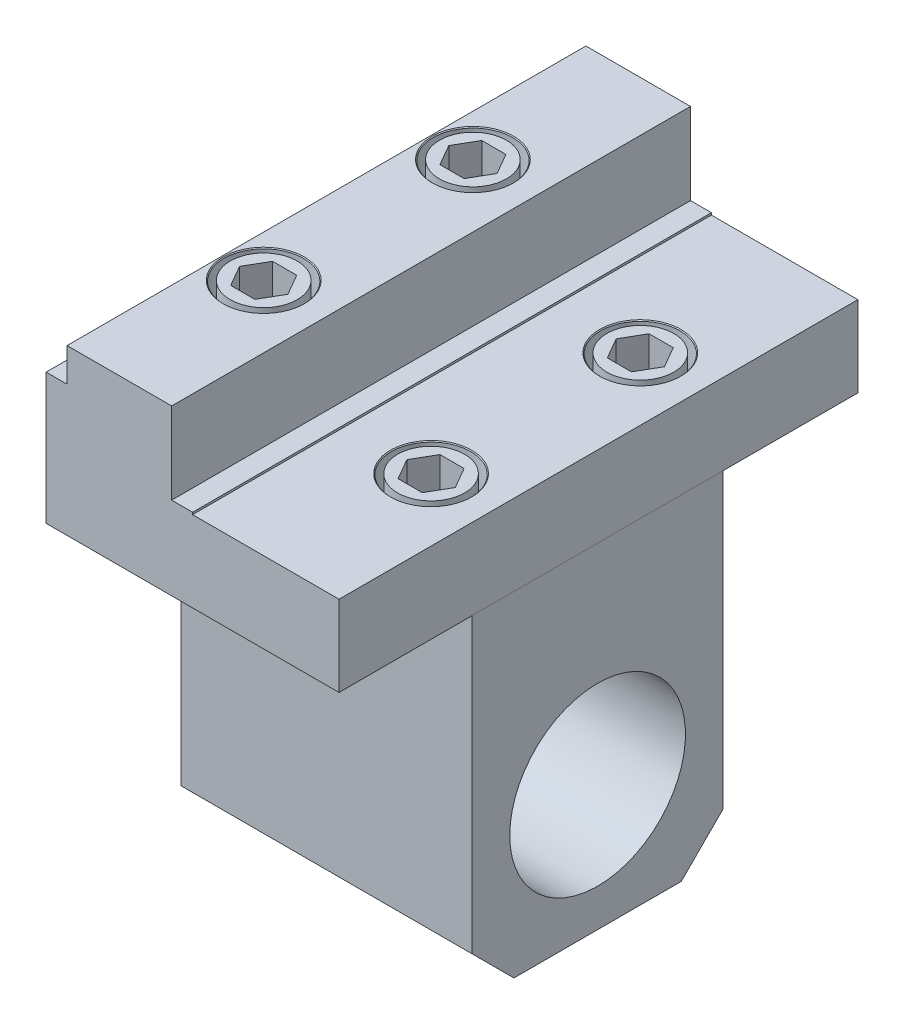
ISO-10303-21;
HEADER;
FILE_DESCRIPTION(('STEP AP214'),'2;1');
FILE_NAME('part.step','',(''),(''),'','','');
FILE_SCHEMA(('AUTOMOTIVE_DESIGN { 1 0 10303 214 1 1 1 1 }'));
ENDSEC;
DATA;
#1=APPLICATION_CONTEXT('core data for automotive mechanical design processes');
#2=APPLICATION_PROTOCOL_DEFINITION('international standard','automotive_design',2000,#1);
#3=PRODUCT_CONTEXT('',#1,'mechanical');
#4=PRODUCT('Part','Part','',(#3));
#5=PRODUCT_RELATED_PRODUCT_CATEGORY('part','',(#4));
#6=PRODUCT_DEFINITION_FORMATION('','',#4);
#7=PRODUCT_DEFINITION_CONTEXT('part definition',#1,'design');
#8=PRODUCT_DEFINITION('design','',#6,#7);
#9=PRODUCT_DEFINITION_SHAPE('','',#8);
#10=(LENGTH_UNIT() NAMED_UNIT(*) SI_UNIT(.MILLI.,.METRE.));
#11=(NAMED_UNIT(*) PLANE_ANGLE_UNIT() SI_UNIT($,.RADIAN.));
#12=(NAMED_UNIT(*) SI_UNIT($,.STERADIAN.) SOLID_ANGLE_UNIT());
#13=UNCERTAINTY_MEASURE_WITH_UNIT(LENGTH_MEASURE(1.E-05),#10,'distance_accuracy_value','');
#14=(GEOMETRIC_REPRESENTATION_CONTEXT(3) GLOBAL_UNCERTAINTY_ASSIGNED_CONTEXT((#13)) GLOBAL_UNIT_ASSIGNED_CONTEXT((#10,
#11,#12)) REPRESENTATION_CONTEXT('',''));
#15=CARTESIAN_POINT('',(0.,0.,0.));
#16=DIRECTION('',(0.,0.,1.));
#17=DIRECTION('',(1.,0.,0.));
#18=AXIS2_PLACEMENT_3D('',#15,#16,#17);
#19=CARTESIAN_POINT('',(0.200000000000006,-80.,-32.));
#20=DIRECTION('',(0.,0.,-1.));
#21=DIRECTION('',(-1.,0.,0.));
#22=AXIS2_PLACEMENT_3D('',#19,#20,#21);
#23=PLANE('',#22);
#24=DIRECTION('',(0.,1.,0.));
#25=VECTOR('',#24,1.);
#26=CARTESIAN_POINT('',(0.200000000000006,-80.,-32.));
#27=LINE('',#26,#25);
#28=CARTESIAN_POINT('',(0.200000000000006,-70.,-32.));
#29=VERTEX_POINT('',#28);
#30=CARTESIAN_POINT('',(0.200000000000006,0.,-32.));
#31=VERTEX_POINT('',#30);
#32=EDGE_CURVE('E104',#29,#31,#27,.T.);
#33=ORIENTED_EDGE('',*,*,#32,.F.);
#34=DIRECTION('',(1.,0.,0.));
#35=VECTOR('',#34,1.);
#36=CARTESIAN_POINT('',(0.200000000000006,-70.,-32.));
#37=LINE('',#36,#35);
#38=CARTESIAN_POINT('',(69.8,-70.,-32.));
#39=VERTEX_POINT('',#38);
#40=EDGE_CURVE('E13',#29,#39,#37,.T.);
#41=ORIENTED_EDGE('',*,*,#40,.T.);
#42=DIRECTION('',(0.,1.,0.));
#43=VECTOR('',#42,1.);
#44=CARTESIAN_POINT('',(69.8,-80.,-32.));
#45=LINE('',#44,#43);
#46=CARTESIAN_POINT('',(69.8,0.,-32.));
#47=VERTEX_POINT('',#46);
#48=EDGE_CURVE('E124',#39,#47,#45,.T.);
#49=ORIENTED_EDGE('',*,*,#48,.T.);
#50=DIRECTION('',(-1.,0.,0.));
#51=VECTOR('',#50,1.);
#52=CARTESIAN_POINT('',(0.200000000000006,0.,-32.));
#53=LINE('',#52,#51);
#54=EDGE_CURVE('E119',#47,#31,#53,.T.);
#55=ORIENTED_EDGE('',*,*,#54,.T.);
#56=EDGE_LOOP('',(#33,#41,#49,#55));
#57=FACE_BOUND('',#56,.T.);
#58=ADVANCED_FACE('F53',(#57),#23,.F.);
#59=CARTESIAN_POINT('',(0.200000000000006,-80.,-92.));
#60=DIRECTION('',(1.,0.,0.));
#61=DIRECTION('',(0.,0.,-1.));
#62=AXIS2_PLACEMENT_3D('',#59,#60,#61);
#63=PLANE('',#62);
#64=CARTESIAN_POINT('',(0.200000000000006,-50.0000000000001,-62.));
#65=DIRECTION('',(-1.,0.,0.));
#66=DIRECTION('',(0.,0.,1.));
#67=AXIS2_PLACEMENT_3D('',#64,#65,#66);
#68=CIRCLE('',#67,21.0000000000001);
#69=CARTESIAN_POINT('',(0.200000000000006,-50.0000000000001,-40.9999999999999));
#70=VERTEX_POINT('',#69);
#71=EDGE_CURVE('E129',#70,#70,#68,.T.);
#72=ORIENTED_EDGE('',*,*,#71,.F.);
#73=EDGE_LOOP('',(#72));
#74=FACE_BOUND('',#73,.T.);
#75=DIRECTION('',(0.,1.,0.));
#76=VECTOR('',#75,1.);
#77=CARTESIAN_POINT('',(0.200000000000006,-80.,-92.));
#78=LINE('',#77,#76);
#79=CARTESIAN_POINT('',(0.200000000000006,-70.,-92.));
#80=VERTEX_POINT('',#79);
#81=CARTESIAN_POINT('',(0.200000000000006,0.,-92.));
#82=VERTEX_POINT('',#81);
#83=EDGE_CURVE('E113',#80,#82,#78,.T.);
#84=ORIENTED_EDGE('',*,*,#83,.F.);
#85=DIRECTION('',(0.,0.707106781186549,-0.707106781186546));
#86=VECTOR('',#85,1.);
#87=CARTESIAN_POINT('',(0.200000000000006,-80.,-82.));
#88=LINE('',#87,#86);
#89=CARTESIAN_POINT('',(0.200000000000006,-80.,-82.));
#90=VERTEX_POINT('',#89);
#91=EDGE_CURVE('E61',#80,#90,#88,.F.);
#92=ORIENTED_EDGE('',*,*,#91,.T.);
#93=DIRECTION('',(0.,0.,-1.));
#94=VECTOR('',#93,1.);
#95=CARTESIAN_POINT('',(0.200000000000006,-80.,-92.));
#96=LINE('',#95,#94);
#97=CARTESIAN_POINT('',(0.200000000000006,-80.,-42.));
#98=VERTEX_POINT('',#97);
#99=EDGE_CURVE('E138',#98,#90,#96,.T.);
#100=ORIENTED_EDGE('',*,*,#99,.F.);
#101=DIRECTION('',(0.,-0.707106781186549,-0.707106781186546));
#102=VECTOR('',#101,1.);
#103=CARTESIAN_POINT('',(0.200000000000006,-80.,-42.));
#104=LINE('',#103,#102);
#105=EDGE_CURVE('E68',#98,#29,#104,.F.);
#106=ORIENTED_EDGE('',*,*,#105,.T.);
#107=ORIENTED_EDGE('',*,*,#32,.T.);
#108=DIRECTION('',(0.,0.,-1.));
#109=VECTOR('',#108,1.);
#110=CARTESIAN_POINT('',(0.200000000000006,0.,-92.));
#111=LINE('',#110,#109);
#112=EDGE_CURVE('E107',#31,#82,#111,.T.);
#113=ORIENTED_EDGE('',*,*,#112,.T.);
#114=EDGE_LOOP('',(#84,#92,#100,#106,#107,#113));
#115=FACE_BOUND('',#114,.T.);
#116=ADVANCED_FACE('F106',(#74,#115),#63,.F.);
#117=CARTESIAN_POINT('',(69.8,-80.,-92.));
#118=DIRECTION('',(0.,0.,1.));
#119=DIRECTION('',(1.,0.,0.));
#120=AXIS2_PLACEMENT_3D('',#117,#118,#119);
#121=PLANE('',#120);
#122=DIRECTION('',(0.,1.,0.));
#123=VECTOR('',#122,1.);
#124=CARTESIAN_POINT('',(69.8,-80.,-92.));
#125=LINE('',#124,#123);
#126=CARTESIAN_POINT('',(69.8,-70.,-92.));
#127=VERTEX_POINT('',#126);
#128=CARTESIAN_POINT('',(69.8,0.,-92.));
#129=VERTEX_POINT('',#128);
#130=EDGE_CURVE('E140',#127,#129,#125,.T.);
#131=ORIENTED_EDGE('',*,*,#130,.F.);
#132=DIRECTION('',(-1.,0.,0.));
#133=VECTOR('',#132,1.);
#134=CARTESIAN_POINT('',(69.8,-70.,-92.));
#135=LINE('',#134,#133);
#136=EDGE_CURVE('E76',#127,#80,#135,.T.);
#137=ORIENTED_EDGE('',*,*,#136,.T.);
#138=ORIENTED_EDGE('',*,*,#83,.T.);
#139=DIRECTION('',(1.,0.,0.));
#140=VECTOR('',#139,1.);
#141=CARTESIAN_POINT('',(69.8,0.,-92.));
#142=LINE('',#141,#140);
#143=EDGE_CURVE('E121',#82,#129,#142,.T.);
#144=ORIENTED_EDGE('',*,*,#143,.T.);
#145=EDGE_LOOP('',(#131,#137,#138,#144));
#146=FACE_BOUND('',#145,.T.);
#147=ADVANCED_FACE('F165',(#146),#121,.F.);
#148=CARTESIAN_POINT('',(69.8,-80.,-32.));
#149=DIRECTION('',(-1.,0.,0.));
#150=DIRECTION('',(0.,0.,1.));
#151=AXIS2_PLACEMENT_3D('',#148,#149,#150);
#152=PLANE('',#151);
#153=CARTESIAN_POINT('',(69.8,-50.0000000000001,-62.));
#154=DIRECTION('',(-1.,0.,0.));
#155=DIRECTION('',(0.,0.,1.));
#156=AXIS2_PLACEMENT_3D('',#153,#154,#155);
#157=CIRCLE('',#156,21.0000000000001);
#158=CARTESIAN_POINT('',(69.8,-50.0000000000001,-40.9999999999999));
#159=VERTEX_POINT('',#158);
#160=EDGE_CURVE('E126',#159,#159,#157,.T.);
#161=ORIENTED_EDGE('',*,*,#160,.T.);
#162=EDGE_LOOP('',(#161));
#163=FACE_BOUND('',#162,.T.);
#164=DIRECTION('',(0.,0.,1.));
#165=VECTOR('',#164,1.);
#166=CARTESIAN_POINT('',(69.8,-80.,-32.));
#167=LINE('',#166,#165);
#168=CARTESIAN_POINT('',(69.8,-80.,-82.));
#169=VERTEX_POINT('',#168);
#170=CARTESIAN_POINT('',(69.8,-80.,-42.));
#171=VERTEX_POINT('',#170);
#172=EDGE_CURVE('E132',#169,#171,#167,.T.);
#173=ORIENTED_EDGE('',*,*,#172,.F.);
#174=DIRECTION('',(0.,-0.707106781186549,0.707106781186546));
#175=VECTOR('',#174,1.);
#176=CARTESIAN_POINT('',(69.8,-80.,-82.));
#177=LINE('',#176,#175);
#178=EDGE_CURVE('E150',#169,#127,#177,.F.);
#179=ORIENTED_EDGE('',*,*,#178,.T.);
#180=ORIENTED_EDGE('',*,*,#130,.T.);
#181=DIRECTION('',(0.,0.,1.));
#182=VECTOR('',#181,1.);
#183=CARTESIAN_POINT('',(69.8,0.,-32.));
#184=LINE('',#183,#182);
#185=EDGE_CURVE('E136',#129,#47,#184,.T.);
#186=ORIENTED_EDGE('',*,*,#185,.T.);
#187=ORIENTED_EDGE('',*,*,#48,.F.);
#188=DIRECTION('',(0.,0.707106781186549,0.707106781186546));
#189=VECTOR('',#188,1.);
#190=CARTESIAN_POINT('',(69.8,-80.,-42.));
#191=LINE('',#190,#189);
#192=EDGE_CURVE('E148',#39,#171,#191,.F.);
#193=ORIENTED_EDGE('',*,*,#192,.T.);
#194=EDGE_LOOP('',(#173,#179,#180,#186,#187,#193));
#195=FACE_BOUND('',#194,.T.);
#196=ADVANCED_FACE('F164',(#163,#195),#152,.F.);
#197=CARTESIAN_POINT('',(69.8,-80.,-32.));
#198=DIRECTION('',(0.,1.,0.));
#199=DIRECTION('',(0.,0.,1.));
#200=AXIS2_PLACEMENT_3D('',#197,#198,#199);
#201=PLANE('',#200);
#202=ORIENTED_EDGE('',*,*,#99,.T.);
#203=DIRECTION('',(1.,0.,0.));
#204=VECTOR('',#203,1.);
#205=CARTESIAN_POINT('',(69.8,-80.,-82.));
#206=LINE('',#205,#204);
#207=EDGE_CURVE('E145',#90,#169,#206,.T.);
#208=ORIENTED_EDGE('',*,*,#207,.T.);
#209=ORIENTED_EDGE('',*,*,#172,.T.);
#210=DIRECTION('',(-1.,0.,0.));
#211=VECTOR('',#210,1.);
#212=CARTESIAN_POINT('',(69.8,-80.,-42.));
#213=LINE('',#212,#211);
#214=EDGE_CURVE('E112',#171,#98,#213,.T.);
#215=ORIENTED_EDGE('',*,*,#214,.T.);
#216=EDGE_LOOP('',(#202,#208,#209,#215));
#217=FACE_BOUND('',#216,.T.);
#218=ADVANCED_FACE('F158',(#217),#201,.F.);
#219=CARTESIAN_POINT('',(69.8,0.,-32.));
#220=DIRECTION('',(0.,1.,0.));
#221=DIRECTION('',(0.,0.,1.));
#222=AXIS2_PLACEMENT_3D('',#219,#220,#221);
#223=PLANE('',#222);
#224=ORIENTED_EDGE('',*,*,#54,.F.);
#225=ORIENTED_EDGE('',*,*,#185,.F.);
#226=ORIENTED_EDGE('',*,*,#143,.F.);
#227=ORIENTED_EDGE('',*,*,#112,.F.);
#228=EDGE_LOOP('',(#224,#225,#226,#227));
#229=FACE_BOUND('',#228,.T.);
#230=ADVANCED_FACE('F117',(#229),#223,.T.);
#231=CARTESIAN_POINT('',(70.,-50.0000000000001,-62.));
#232=DIRECTION('',(-1.,0.,0.));
#233=DIRECTION('',(0.,0.,1.));
#234=AXIS2_PLACEMENT_3D('',#231,#232,#233);
#235=CYLINDRICAL_SURFACE('',#234,21.0000000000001);
#236=ORIENTED_EDGE('',*,*,#71,.T.);
#237=EDGE_LOOP('',(#236));
#238=FACE_BOUND('',#237,.T.);
#239=ORIENTED_EDGE('',*,*,#160,.F.);
#240=EDGE_LOOP('',(#239));
#241=FACE_BOUND('',#240,.T.);
#242=ADVANCED_FACE('F172',(#238,#241),#235,.F.);
#243=CARTESIAN_POINT('',(69.8,-80.,-82.));
#244=DIRECTION('',(0.,0.707106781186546,0.707106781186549));
#245=DIRECTION('',(0.,-0.707106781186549,0.707106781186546));
#246=AXIS2_PLACEMENT_3D('',#243,#244,#245);
#247=PLANE('',#246);
#248=ORIENTED_EDGE('',*,*,#91,.F.);
#249=ORIENTED_EDGE('',*,*,#136,.F.);
#250=ORIENTED_EDGE('',*,*,#178,.F.);
#251=ORIENTED_EDGE('',*,*,#207,.F.);
#252=EDGE_LOOP('',(#248,#249,#250,#251));
#253=FACE_BOUND('',#252,.T.);
#254=ADVANCED_FACE('F162',(#253),#247,.F.);
#255=CARTESIAN_POINT('',(69.8,-80.,-42.));
#256=DIRECTION('',(0.,0.707106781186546,-0.707106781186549));
#257=DIRECTION('',(0.,0.707106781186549,0.707106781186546));
#258=AXIS2_PLACEMENT_3D('',#255,#256,#257);
#259=PLANE('',#258);
#260=ORIENTED_EDGE('',*,*,#192,.F.);
#261=ORIENTED_EDGE('',*,*,#40,.F.);
#262=ORIENTED_EDGE('',*,*,#105,.F.);
#263=ORIENTED_EDGE('',*,*,#214,.F.);
#264=EDGE_LOOP('',(#260,#261,#262,#263));
#265=FACE_BOUND('',#264,.T.);
#266=ADVANCED_FACE('F55',(#265),#259,.F.);
#267=CLOSED_SHELL('',(#58,#116,#147,#196,#218,#230,#242,#254,#266));
#268=MANIFOLD_SOLID_BREP('B2',#267);
#269=CARTESIAN_POINT('',(55.,0.,-87.));
#270=DIRECTION('',(0.,1.,0.));
#271=DIRECTION('',(0.,0.,1.));
#272=AXIS2_PLACEMENT_3D('',#269,#270,#271);
#273=CYLINDRICAL_SURFACE('',#272,5.5);
#274=CARTESIAN_POINT('',(55.,0.199999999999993,-87.));
#275=DIRECTION('',(0.,-1.,0.));
#276=DIRECTION('',(0.,0.,-1.));
#277=AXIS2_PLACEMENT_3D('',#274,#275,#276);
#278=CIRCLE('',#277,5.5);
#279=CARTESIAN_POINT('',(55.,0.199999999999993,-92.5));
#280=VERTEX_POINT('',#279);
#281=EDGE_CURVE('E794',#280,#280,#278,.T.);
#282=ORIENTED_EDGE('',*,*,#281,.T.);
#283=EDGE_LOOP('',(#282));
#284=FACE_BOUND('',#283,.T.);
#285=CARTESIAN_POINT('',(55.,9.,-87.));
#286=DIRECTION('',(0.,1.,0.));
#287=DIRECTION('',(0.,0.,1.));
#288=AXIS2_PLACEMENT_3D('',#285,#286,#287);
#289=CIRCLE('',#288,5.5);
#290=CARTESIAN_POINT('',(55.,9.,-81.5));
#291=VERTEX_POINT('',#290);
#292=EDGE_CURVE('E51',#291,#291,#289,.F.);
#293=ORIENTED_EDGE('',*,*,#292,.F.);
#294=EDGE_LOOP('',(#293));
#295=FACE_BOUND('',#294,.T.);
#296=ADVANCED_FACE('F278',(#284,#295),#273,.F.);
#297=CARTESIAN_POINT('',(55.,10.,-87.));
#298=DIRECTION('',(0.,1.,0.));
#299=DIRECTION('',(0.,0.,1.));
#300=AXIS2_PLACEMENT_3D('',#297,#298,#299);
#301=PLANE('',#300);
#302=DIRECTION('',(-0.500000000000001,0.,0.866025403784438));
#303=VECTOR('',#302,1.);
#304=CARTESIAN_POINT('',(50.6698729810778,10.,-89.5));
#305=LINE('',#304,#303);
#306=CARTESIAN_POINT('',(52.1132486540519,10.,-92.));
#307=VERTEX_POINT('',#306);
#308=CARTESIAN_POINT('',(49.2264973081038,10.,-87.));
#309=VERTEX_POINT('',#308);
#310=EDGE_CURVE('E293',#307,#309,#305,.T.);
#311=ORIENTED_EDGE('',*,*,#310,.T.);
#312=DIRECTION('',(0.5,0.,0.866025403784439));
#313=VECTOR('',#312,1.);
#314=CARTESIAN_POINT('',(50.6698729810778,10.,-84.5));
#315=LINE('',#314,#313);
#316=CARTESIAN_POINT('',(52.1132486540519,10.,-82.));
#317=VERTEX_POINT('',#316);
#318=EDGE_CURVE('E517',#309,#317,#315,.T.);
#319=ORIENTED_EDGE('',*,*,#318,.T.);
#320=DIRECTION('',(1.,0.,0.));
#321=VECTOR('',#320,1.);
#322=CARTESIAN_POINT('',(55.,10.,-82.));
#323=LINE('',#322,#321);
#324=CARTESIAN_POINT('',(57.8867513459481,10.,-82.));
#325=VERTEX_POINT('',#324);
#326=EDGE_CURVE('E886',#317,#325,#323,.T.);
#327=ORIENTED_EDGE('',*,*,#326,.T.);
#328=DIRECTION('',(0.5,0.,-0.866025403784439));
#329=VECTOR('',#328,1.);
#330=CARTESIAN_POINT('',(59.3301270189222,10.,-84.5));
#331=LINE('',#330,#329);
#332=CARTESIAN_POINT('',(60.7735026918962,10.,-87.));
#333=VERTEX_POINT('',#332);
#334=EDGE_CURVE('E884',#325,#333,#331,.T.);
#335=ORIENTED_EDGE('',*,*,#334,.T.);
#336=DIRECTION('',(-0.500000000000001,0.,-0.866025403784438));
#337=VECTOR('',#336,1.);
#338=CARTESIAN_POINT('',(59.3301270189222,10.,-89.5));
#339=LINE('',#338,#337);
#340=CARTESIAN_POINT('',(57.8867513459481,10.,-92.));
#341=VERTEX_POINT('',#340);
#342=EDGE_CURVE('E882',#333,#341,#339,.T.);
#343=ORIENTED_EDGE('',*,*,#342,.T.);
#344=DIRECTION('',(-1.,0.,0.));
#345=VECTOR('',#344,1.);
#346=CARTESIAN_POINT('',(55.,10.,-92.));
#347=LINE('',#346,#345);
#348=EDGE_CURVE('E879',#341,#307,#347,.T.);
#349=ORIENTED_EDGE('',*,*,#348,.T.);
#350=EDGE_LOOP('',(#311,#319,#327,#335,#343,#349));
#351=FACE_BOUND('',#350,.T.);
#352=ADVANCED_FACE('F913',(#351),#301,.T.);
#353=CARTESIAN_POINT('',(55.,10.,-37.));
#354=DIRECTION('',(0.,1.,0.));
#355=DIRECTION('',(0.,0.,1.));
#356=AXIS2_PLACEMENT_3D('',#353,#354,#355);
#357=PLANE('',#356);
#358=DIRECTION('',(1.,0.,0.));
#359=VECTOR('',#358,1.);
#360=CARTESIAN_POINT('',(55.,10.,-32.));
#361=LINE('',#360,#359);
#362=CARTESIAN_POINT('',(52.1132486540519,10.,-32.));
#363=VERTEX_POINT('',#362);
#364=CARTESIAN_POINT('',(57.8867513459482,10.,-32.));
#365=VERTEX_POINT('',#364);
#366=EDGE_CURVE('E301',#363,#365,#361,.T.);
#367=ORIENTED_EDGE('',*,*,#366,.T.);
#368=DIRECTION('',(0.499999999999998,0.,-0.86602540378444));
#369=VECTOR('',#368,1.);
#370=CARTESIAN_POINT('',(59.3301270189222,10.,-34.5));
#371=LINE('',#370,#369);
#372=CARTESIAN_POINT('',(60.7735026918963,10.,-37.));
#373=VERTEX_POINT('',#372);
#374=EDGE_CURVE('E862',#365,#373,#371,.T.);
#375=ORIENTED_EDGE('',*,*,#374,.T.);
#376=DIRECTION('',(-0.499999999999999,0.,-0.866025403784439));
#377=VECTOR('',#376,1.);
#378=CARTESIAN_POINT('',(59.3301270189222,10.,-39.5));
#379=LINE('',#378,#377);
#380=CARTESIAN_POINT('',(57.8867513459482,10.,-42.));
#381=VERTEX_POINT('',#380);
#382=EDGE_CURVE('E873',#373,#381,#379,.T.);
#383=ORIENTED_EDGE('',*,*,#382,.T.);
#384=DIRECTION('',(-1.,0.,0.));
#385=VECTOR('',#384,1.);
#386=CARTESIAN_POINT('',(55.,10.,-42.));
#387=LINE('',#386,#385);
#388=CARTESIAN_POINT('',(52.1132486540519,10.,-42.));
#389=VERTEX_POINT('',#388);
#390=EDGE_CURVE('E871',#381,#389,#387,.T.);
#391=ORIENTED_EDGE('',*,*,#390,.T.);
#392=DIRECTION('',(-0.499999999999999,0.,0.866025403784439));
#393=VECTOR('',#392,1.);
#394=CARTESIAN_POINT('',(50.6698729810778,10.,-39.5));
#395=LINE('',#394,#393);
#396=CARTESIAN_POINT('',(49.2264973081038,10.,-37.));
#397=VERTEX_POINT('',#396);
#398=EDGE_CURVE('E869',#389,#397,#395,.T.);
#399=ORIENTED_EDGE('',*,*,#398,.T.);
#400=DIRECTION('',(0.499999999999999,0.,0.866025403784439));
#401=VECTOR('',#400,1.);
#402=CARTESIAN_POINT('',(50.6698729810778,10.,-34.5));
#403=LINE('',#402,#401);
#404=EDGE_CURVE('E866',#397,#363,#403,.T.);
#405=ORIENTED_EDGE('',*,*,#404,.T.);
#406=EDGE_LOOP('',(#367,#375,#383,#391,#399,#405));
#407=FACE_BOUND('',#406,.T.);
#408=ADVANCED_FACE('F919',(#407),#357,.T.);
#409=CARTESIAN_POINT('',(15.,0.,-37.));
#410=DIRECTION('',(0.,1.,0.));
#411=DIRECTION('',(0.,0.,1.));
#412=AXIS2_PLACEMENT_3D('',#409,#410,#411);
#413=CYLINDRICAL_SURFACE('',#412,5.5);
#414=CARTESIAN_POINT('',(15.,0.200000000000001,-37.));
#415=DIRECTION('',(0.,-1.,0.));
#416=DIRECTION('',(0.,0.,-1.));
#417=AXIS2_PLACEMENT_3D('',#414,#415,#416);
#418=CIRCLE('',#417,5.5);
#419=CARTESIAN_POINT('',(15.,0.200000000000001,-42.5));
#420=VERTEX_POINT('',#419);
#421=EDGE_CURVE('E797',#420,#420,#418,.T.);
#422=ORIENTED_EDGE('',*,*,#421,.T.);
#423=EDGE_LOOP('',(#422));
#424=FACE_BOUND('',#423,.T.);
#425=CARTESIAN_POINT('',(15.,28.5,-37.));
#426=DIRECTION('',(0.,1.,0.));
#427=DIRECTION('',(0.,0.,1.));
#428=AXIS2_PLACEMENT_3D('',#425,#426,#427);
#429=CIRCLE('',#428,5.5);
#430=CARTESIAN_POINT('',(15.,28.5,-31.5));
#431=VERTEX_POINT('',#430);
#432=EDGE_CURVE('E859',#431,#431,#429,.F.);
#433=ORIENTED_EDGE('',*,*,#432,.F.);
#434=EDGE_LOOP('',(#433));
#435=FACE_BOUND('',#434,.T.);
#436=ADVANCED_FACE('F1032',(#424,#435),#413,.F.);
#437=CARTESIAN_POINT('',(15.,29.5,-87.));
#438=DIRECTION('',(0.,1.,0.));
#439=DIRECTION('',(0.,0.,1.));
#440=AXIS2_PLACEMENT_3D('',#437,#438,#439);
#441=PLANE('',#440);
#442=CARTESIAN_POINT('',(15.,29.5,-87.));
#443=DIRECTION('',(0.,1.,0.));
#444=DIRECTION('',(0.,0.,1.));
#445=AXIS2_PLACEMENT_3D('',#442,#443,#444);
#446=CIRCLE('',#445,9.50000000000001);
#447=CARTESIAN_POINT('',(15.,29.5,-77.5));
#448=VERTEX_POINT('',#447);
#449=EDGE_CURVE('E703',#448,#448,#446,.T.);
#450=ORIENTED_EDGE('',*,*,#449,.T.);
#451=EDGE_LOOP('',(#450));
#452=FACE_BOUND('',#451,.T.);
#453=CARTESIAN_POINT('',(15.,29.5,-87.));
#454=DIRECTION('',(0.,1.,0.));
#455=DIRECTION('',(0.,0.,-1.));
#456=AXIS2_PLACEMENT_3D('',#453,#454,#455);
#457=CIRCLE('',#456,8.);
#458=CARTESIAN_POINT('',(15.,29.5,-95.));
#459=VERTEX_POINT('',#458);
#460=EDGE_CURVE('E634',#459,#459,#457,.T.);
#461=ORIENTED_EDGE('',*,*,#460,.F.);
#462=EDGE_LOOP('',(#461));
#463=FACE_BOUND('',#462,.T.);
#464=ADVANCED_FACE('F1029',(#452,#463),#441,.T.);
#465=CARTESIAN_POINT('',(15.,29.5,-37.));
#466=DIRECTION('',(0.,1.,0.));
#467=DIRECTION('',(0.,0.,1.));
#468=AXIS2_PLACEMENT_3D('',#465,#466,#467);
#469=PLANE('',#468);
#470=CARTESIAN_POINT('',(15.,29.5,-37.));
#471=DIRECTION('',(0.,1.,0.));
#472=DIRECTION('',(0.,0.,1.));
#473=AXIS2_PLACEMENT_3D('',#470,#471,#472);
#474=CIRCLE('',#473,9.50000000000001);
#475=CARTESIAN_POINT('',(15.,29.5,-27.5));
#476=VERTEX_POINT('',#475);
#477=EDGE_CURVE('E699',#476,#476,#474,.T.);
#478=ORIENTED_EDGE('',*,*,#477,.T.);
#479=EDGE_LOOP('',(#478));
#480=FACE_BOUND('',#479,.T.);
#481=CARTESIAN_POINT('',(15.,29.5,-37.));
#482=DIRECTION('',(0.,1.,0.));
#483=DIRECTION('',(0.,0.,1.));
#484=AXIS2_PLACEMENT_3D('',#481,#482,#483);
#485=CIRCLE('',#484,8.);
#486=CARTESIAN_POINT('',(15.,29.5,-29.));
#487=VERTEX_POINT('',#486);
#488=EDGE_CURVE('E676',#487,#487,#485,.T.);
#489=ORIENTED_EDGE('',*,*,#488,.F.);
#490=EDGE_LOOP('',(#489));
#491=FACE_BOUND('',#490,.T.);
#492=ADVANCED_FACE('F964',(#480,#491),#469,.T.);
#493=CARTESIAN_POINT('',(70.,20.,-124.));
#494=DIRECTION('',(1.,0.,0.));
#495=DIRECTION('',(0.,0.,-1.));
#496=AXIS2_PLACEMENT_3D('',#493,#494,#495);
#497=PLANE('',#496);
#498=DIRECTION('',(0.,1.,0.));
#499=VECTOR('',#498,1.);
#500=CARTESIAN_POINT('',(70.,20.,0.));
#501=LINE('',#500,#499);
#502=CARTESIAN_POINT('',(70.,0.200000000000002,0.));
#503=VERTEX_POINT('',#502);
#504=CARTESIAN_POINT('',(70.,19.5,0.));
#505=VERTEX_POINT('',#504);
#506=EDGE_CURVE('E712',#503,#505,#501,.T.);
#507=ORIENTED_EDGE('',*,*,#506,.F.);
#508=DIRECTION('',(0.,0.,-1.));
#509=VECTOR('',#508,1.);
#510=CARTESIAN_POINT('',(70.,0.199999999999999,-124.));
#511=LINE('',#510,#509);
#512=CARTESIAN_POINT('',(70.,0.200000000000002,-124.));
#513=VERTEX_POINT('',#512);
#514=EDGE_CURVE('E785',#503,#513,#511,.T.);
#515=ORIENTED_EDGE('',*,*,#514,.T.);
#516=DIRECTION('',(0.,1.,0.));
#517=VECTOR('',#516,1.);
#518=CARTESIAN_POINT('',(70.,20.,-124.));
#519=LINE('',#518,#517);
#520=CARTESIAN_POINT('',(70.,19.5,-124.));
#521=VERTEX_POINT('',#520);
#522=EDGE_CURVE('E713',#513,#521,#519,.T.);
#523=ORIENTED_EDGE('',*,*,#522,.T.);
#524=DIRECTION('',(0.,0.,-1.));
#525=VECTOR('',#524,1.);
#526=CARTESIAN_POINT('',(70.,19.5,0.));
#527=LINE('',#526,#525);
#528=EDGE_CURVE('E681',#505,#521,#527,.T.);
#529=ORIENTED_EDGE('',*,*,#528,.F.);
#530=EDGE_LOOP('',(#507,#515,#523,#529));
#531=FACE_BOUND('',#530,.T.);
#532=ADVANCED_FACE('F960',(#531),#497,.T.);
#533=CARTESIAN_POINT('',(55.,10.,-87.));
#534=DIRECTION('',(0.,1.,0.));
#535=DIRECTION('',(0.,0.,1.));
#536=AXIS2_PLACEMENT_3D('',#533,#534,#535);
#537=CYLINDRICAL_SURFACE('',#536,9.49999999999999);
#538=CARTESIAN_POINT('',(55.,19.3,-87.));
#539=DIRECTION('',(0.,1.,0.));
#540=DIRECTION('',(0.,0.,1.));
#541=AXIS2_PLACEMENT_3D('',#538,#539,#540);
#542=CIRCLE('',#541,9.49999999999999);
#543=CARTESIAN_POINT('',(55.,19.3,-77.5));
#544=VERTEX_POINT('',#543);
#545=EDGE_CURVE('E812',#544,#544,#542,.T.);
#546=ORIENTED_EDGE('',*,*,#545,.T.);
#547=EDGE_LOOP('',(#546));
#548=FACE_BOUND('',#547,.T.);
#549=CARTESIAN_POINT('',(55.,10.,-87.));
#550=DIRECTION('',(0.,1.,0.));
#551=DIRECTION('',(0.,0.,1.));
#552=AXIS2_PLACEMENT_3D('',#549,#550,#551);
#553=CIRCLE('',#552,9.49999999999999);
#554=CARTESIAN_POINT('',(55.,10.,-77.5));
#555=VERTEX_POINT('',#554);
#556=EDGE_CURVE('E709',#555,#555,#553,.T.);
#557=ORIENTED_EDGE('',*,*,#556,.F.);
#558=EDGE_LOOP('',(#557));
#559=FACE_BOUND('',#558,.T.);
#560=ADVANCED_FACE('F963',(#548,#559),#537,.F.);
#561=CARTESIAN_POINT('',(55.,10.,-37.));
#562=DIRECTION('',(0.,1.,0.));
#563=DIRECTION('',(0.,0.,1.));
#564=AXIS2_PLACEMENT_3D('',#561,#562,#563);
#565=CYLINDRICAL_SURFACE('',#564,9.5);
#566=CARTESIAN_POINT('',(55.,19.3,-37.));
#567=DIRECTION('',(0.,1.,0.));
#568=DIRECTION('',(0.,0.,1.));
#569=AXIS2_PLACEMENT_3D('',#566,#567,#568);
#570=CIRCLE('',#569,9.5);
#571=CARTESIAN_POINT('',(55.,19.3,-27.5));
#572=VERTEX_POINT('',#571);
#573=EDGE_CURVE('E809',#572,#572,#570,.T.);
#574=ORIENTED_EDGE('',*,*,#573,.T.);
#575=EDGE_LOOP('',(#574));
#576=FACE_BOUND('',#575,.T.);
#577=CARTESIAN_POINT('',(55.,10.,-37.));
#578=DIRECTION('',(0.,1.,0.));
#579=DIRECTION('',(0.,0.,1.));
#580=AXIS2_PLACEMENT_3D('',#577,#578,#579);
#581=CIRCLE('',#580,9.5);
#582=CARTESIAN_POINT('',(55.,10.,-27.5));
#583=VERTEX_POINT('',#582);
#584=EDGE_CURVE('E706',#583,#583,#581,.T.);
#585=ORIENTED_EDGE('',*,*,#584,.F.);
#586=EDGE_LOOP('',(#585));
#587=FACE_BOUND('',#586,.T.);
#588=ADVANCED_FACE('F1130',(#576,#587),#565,.F.);
#589=CARTESIAN_POINT('',(15.,0.,-87.));
#590=DIRECTION('',(0.,1.,0.));
#591=DIRECTION('',(0.,0.,1.));
#592=AXIS2_PLACEMENT_3D('',#589,#590,#591);
#593=CYLINDRICAL_SURFACE('',#592,5.5);
#594=CARTESIAN_POINT('',(15.,28.5,-87.));
#595=DIRECTION('',(0.,-1.,0.));
#596=DIRECTION('',(0.,0.,-1.));
#597=AXIS2_PLACEMENT_3D('',#594,#595,#596);
#598=CIRCLE('',#597,5.5);
#599=CARTESIAN_POINT('',(15.,28.5,-92.5));
#600=VERTEX_POINT('',#599);
#601=EDGE_CURVE('E572',#600,#600,#598,.F.);
#602=ORIENTED_EDGE('',*,*,#601,.T.);
#603=EDGE_LOOP('',(#602));
#604=FACE_BOUND('',#603,.T.);
#605=CARTESIAN_POINT('',(15.,0.200000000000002,-87.));
#606=DIRECTION('',(0.,-1.,0.));
#607=DIRECTION('',(0.,0.,-1.));
#608=AXIS2_PLACEMENT_3D('',#605,#606,#607);
#609=CIRCLE('',#608,5.5);
#610=CARTESIAN_POINT('',(15.,0.200000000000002,-92.5));
#611=VERTEX_POINT('',#610);
#612=EDGE_CURVE('E791',#611,#611,#609,.T.);
#613=ORIENTED_EDGE('',*,*,#612,.T.);
#614=EDGE_LOOP('',(#613));
#615=FACE_BOUND('',#614,.T.);
#616=ADVANCED_FACE('F1132',(#604,#615),#593,.F.);
#617=CARTESIAN_POINT('',(55.,0.,-37.));
#618=DIRECTION('',(0.,1.,0.));
#619=DIRECTION('',(0.,0.,1.));
#620=AXIS2_PLACEMENT_3D('',#617,#618,#619);
#621=CYLINDRICAL_SURFACE('',#620,5.5);
#622=CARTESIAN_POINT('',(55.,9.,-37.));
#623=DIRECTION('',(0.,-1.,0.));
#624=DIRECTION('',(0.,0.,-1.));
#625=AXIS2_PLACEMENT_3D('',#622,#623,#624);
#626=CIRCLE('',#625,5.5);
#627=CARTESIAN_POINT('',(55.,9.,-42.5));
#628=VERTEX_POINT('',#627);
#629=EDGE_CURVE('E889',#628,#628,#626,.F.);
#630=ORIENTED_EDGE('',*,*,#629,.T.);
#631=EDGE_LOOP('',(#630));
#632=FACE_BOUND('',#631,.T.);
#633=CARTESIAN_POINT('',(55.,0.200000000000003,-37.));
#634=DIRECTION('',(0.,-1.,0.));
#635=DIRECTION('',(0.,0.,-1.));
#636=AXIS2_PLACEMENT_3D('',#633,#634,#635);
#637=CIRCLE('',#636,5.5);
#638=CARTESIAN_POINT('',(55.,0.200000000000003,-42.5));
#639=VERTEX_POINT('',#638);
#640=EDGE_CURVE('E800',#639,#639,#637,.T.);
#641=ORIENTED_EDGE('',*,*,#640,.T.);
#642=EDGE_LOOP('',(#641));
#643=FACE_BOUND('',#642,.T.);
#644=ADVANCED_FACE('F925',(#632,#643),#621,.F.);
#645=CARTESIAN_POINT('',(70.,0.,-124.));
#646=DIRECTION('',(0.,-1.,0.));
#647=DIRECTION('',(0.,0.,-1.));
#648=AXIS2_PLACEMENT_3D('',#645,#646,#647);
#649=PLANE('',#648);
#650=DIRECTION('',(0.,0.,-1.));
#651=VECTOR('',#650,1.);
#652=CARTESIAN_POINT('',(0.200000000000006,0.,-124.));
#653=LINE('',#652,#651);
#654=CARTESIAN_POINT('',(0.200000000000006,0.,-0.200000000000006));
#655=VERTEX_POINT('',#654);
#656=CARTESIAN_POINT('',(0.200000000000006,0.,-123.8));
#657=VERTEX_POINT('',#656);
#658=EDGE_CURVE('E773',#655,#657,#653,.T.);
#659=ORIENTED_EDGE('',*,*,#658,.T.);
#660=DIRECTION('',(1.,0.,0.));
#661=VECTOR('',#660,1.);
#662=CARTESIAN_POINT('',(70.,0.,-123.8));
#663=LINE('',#662,#661);
#664=CARTESIAN_POINT('',(69.8,0.,-123.8));
#665=VERTEX_POINT('',#664);
#666=EDGE_CURVE('E779',#657,#665,#663,.T.);
#667=ORIENTED_EDGE('',*,*,#666,.T.);
#668=DIRECTION('',(0.,0.,1.));
#669=VECTOR('',#668,1.);
#670=CARTESIAN_POINT('',(69.8,0.,-124.));
#671=LINE('',#670,#669);
#672=CARTESIAN_POINT('',(69.8,0.,-0.200000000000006));
#673=VERTEX_POINT('',#672);
#674=EDGE_CURVE('E777',#665,#673,#671,.T.);
#675=ORIENTED_EDGE('',*,*,#674,.T.);
#676=DIRECTION('',(-1.,0.,0.));
#677=VECTOR('',#676,1.);
#678=CARTESIAN_POINT('',(0.,0.,-0.200000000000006));
#679=LINE('',#678,#677);
#680=EDGE_CURVE('E775',#673,#655,#679,.T.);
#681=ORIENTED_EDGE('',*,*,#680,.T.);
#682=EDGE_LOOP('',(#659,#667,#675,#681));
#683=FACE_BOUND('',#682,.T.);
#684=CARTESIAN_POINT('',(15.,0.,-87.));
#685=DIRECTION('',(0.,-1.,0.));
#686=DIRECTION('',(0.,0.,-1.));
#687=AXIS2_PLACEMENT_3D('',#684,#685,#686);
#688=CIRCLE('',#687,5.70000000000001);
#689=CARTESIAN_POINT('',(15.,0.,-92.7));
#690=VERTEX_POINT('',#689);
#691=EDGE_CURVE('E770',#690,#690,#688,.F.);
#692=ORIENTED_EDGE('',*,*,#691,.T.);
#693=EDGE_LOOP('',(#692));
#694=FACE_BOUND('',#693,.T.);
#695=CARTESIAN_POINT('',(55.,0.,-87.));
#696=DIRECTION('',(0.,-1.,0.));
#697=DIRECTION('',(0.,0.,-1.));
#698=AXIS2_PLACEMENT_3D('',#695,#696,#697);
#699=CIRCLE('',#698,5.7);
#700=CARTESIAN_POINT('',(55.,0.,-92.7));
#701=VERTEX_POINT('',#700);
#702=EDGE_CURVE('E767',#701,#701,#699,.F.);
#703=ORIENTED_EDGE('',*,*,#702,.T.);
#704=EDGE_LOOP('',(#703));
#705=FACE_BOUND('',#704,.T.);
#706=CARTESIAN_POINT('',(15.,0.,-37.));
#707=DIRECTION('',(0.,-1.,0.));
#708=DIRECTION('',(0.,0.,-1.));
#709=AXIS2_PLACEMENT_3D('',#706,#707,#708);
#710=CIRCLE('',#709,5.7);
#711=CARTESIAN_POINT('',(15.,0.,-42.7));
#712=VERTEX_POINT('',#711);
#713=EDGE_CURVE('E764',#712,#712,#710,.F.);
#714=ORIENTED_EDGE('',*,*,#713,.T.);
#715=EDGE_LOOP('',(#714));
#716=FACE_BOUND('',#715,.T.);
#717=CARTESIAN_POINT('',(55.,0.,-37.));
#718=DIRECTION('',(0.,-1.,0.));
#719=DIRECTION('',(0.,0.,-1.));
#720=AXIS2_PLACEMENT_3D('',#717,#718,#719);
#721=CIRCLE('',#720,5.7);
#722=CARTESIAN_POINT('',(55.,0.,-42.7));
#723=VERTEX_POINT('',#722);
#724=EDGE_CURVE('E753',#723,#723,#721,.F.);
#725=ORIENTED_EDGE('',*,*,#724,.T.);
#726=EDGE_LOOP('',(#725));
#727=FACE_BOUND('',#726,.T.);
#728=ADVANCED_FACE('F940',(#683,#694,#705,#716,#727),#649,.T.);
#729=CARTESIAN_POINT('',(0.,0.,-124.));
#730=DIRECTION('',(-1.,0.,0.));
#731=DIRECTION('',(0.,0.,1.));
#732=AXIS2_PLACEMENT_3D('',#729,#730,#731);
#733=PLANE('',#732);
#734=DIRECTION('',(0.,-1.,0.));
#735=VECTOR('',#734,1.);
#736=CARTESIAN_POINT('',(0.,0.,-124.));
#737=LINE('',#736,#735);
#738=CARTESIAN_POINT('',(0.,31.5,-124.));
#739=VERTEX_POINT('',#738);
#740=CARTESIAN_POINT('',(0.,0.2,-124.));
#741=VERTEX_POINT('',#740);
#742=EDGE_CURVE('E730',#739,#741,#737,.T.);
#743=ORIENTED_EDGE('',*,*,#742,.T.);
#744=DIRECTION('',(0.,0.,1.));
#745=VECTOR('',#744,1.);
#746=CARTESIAN_POINT('',(0.,0.2,-124.));
#747=LINE('',#746,#745);
#748=CARTESIAN_POINT('',(0.,0.2,0.));
#749=VERTEX_POINT('',#748);
#750=EDGE_CURVE('E789',#741,#749,#747,.T.);
#751=ORIENTED_EDGE('',*,*,#750,.T.);
#752=DIRECTION('',(0.,-1.,0.));
#753=VECTOR('',#752,1.);
#754=CARTESIAN_POINT('',(0.,0.,0.));
#755=LINE('',#754,#753);
#756=CARTESIAN_POINT('',(0.,31.5,0.));
#757=VERTEX_POINT('',#756);
#758=EDGE_CURVE('E716',#757,#749,#755,.T.);
#759=ORIENTED_EDGE('',*,*,#758,.F.);
#760=DIRECTION('',(0.,0.,1.));
#761=VECTOR('',#760,1.);
#762=CARTESIAN_POINT('',(0.,31.5,-124.));
#763=LINE('',#762,#761);
#764=EDGE_CURVE('E751',#739,#757,#763,.T.);
#765=ORIENTED_EDGE('',*,*,#764,.F.);
#766=EDGE_LOOP('',(#743,#751,#759,#765));
#767=FACE_BOUND('',#766,.T.);
#768=ADVANCED_FACE('F936',(#767),#733,.T.);
#769=CARTESIAN_POINT('',(0.,31.5,-124.));
#770=DIRECTION('',(0.,1.,0.));
#771=DIRECTION('',(0.,0.,1.));
#772=AXIS2_PLACEMENT_3D('',#769,#770,#771);
#773=PLANE('',#772);
#774=DIRECTION('',(-1.,0.,0.));
#775=VECTOR('',#774,1.);
#776=CARTESIAN_POINT('',(0.,31.5,0.));
#777=LINE('',#776,#775);
#778=CARTESIAN_POINT('',(5.,31.5,0.));
#779=VERTEX_POINT('',#778);
#780=EDGE_CURVE('E746',#779,#757,#777,.T.);
#781=ORIENTED_EDGE('',*,*,#780,.F.);
#782=DIRECTION('',(0.,0.,1.));
#783=VECTOR('',#782,1.);
#784=CARTESIAN_POINT('',(5.,31.5,-124.));
#785=LINE('',#784,#783);
#786=CARTESIAN_POINT('',(5.,31.5,-124.));
#787=VERTEX_POINT('',#786);
#788=EDGE_CURVE('E754',#787,#779,#785,.T.);
#789=ORIENTED_EDGE('',*,*,#788,.F.);
#790=DIRECTION('',(-1.,0.,0.));
#791=VECTOR('',#790,1.);
#792=CARTESIAN_POINT('',(0.,31.5,-124.));
#793=LINE('',#792,#791);
#794=EDGE_CURVE('E727',#787,#739,#793,.T.);
#795=ORIENTED_EDGE('',*,*,#794,.T.);
#796=ORIENTED_EDGE('',*,*,#764,.T.);
#797=EDGE_LOOP('',(#781,#789,#795,#796));
#798=FACE_BOUND('',#797,.T.);
#799=ADVANCED_FACE('F939',(#798),#773,.T.);
#800=CARTESIAN_POINT('',(5.,31.5,-124.));
#801=DIRECTION('',(-1.,0.,0.));
#802=DIRECTION('',(0.,0.,1.));
#803=AXIS2_PLACEMENT_3D('',#800,#801,#802);
#804=PLANE('',#803);
#805=DIRECTION('',(0.,-1.,0.));
#806=VECTOR('',#805,1.);
#807=CARTESIAN_POINT('',(5.,31.5,0.));
#808=LINE('',#807,#806);
#809=CARTESIAN_POINT('',(5.,39.5,0.));
#810=VERTEX_POINT('',#809);
#811=EDGE_CURVE('E743',#810,#779,#808,.T.);
#812=ORIENTED_EDGE('',*,*,#811,.F.);
#813=DIRECTION('',(0.,0.,1.));
#814=VECTOR('',#813,1.);
#815=CARTESIAN_POINT('',(5.,39.5,-124.));
#816=LINE('',#815,#814);
#817=CARTESIAN_POINT('',(5.,39.5,-124.));
#818=VERTEX_POINT('',#817);
#819=EDGE_CURVE('E756',#818,#810,#816,.T.);
#820=ORIENTED_EDGE('',*,*,#819,.F.);
#821=DIRECTION('',(0.,-1.,0.));
#822=VECTOR('',#821,1.);
#823=CARTESIAN_POINT('',(5.,31.5,-124.));
#824=LINE('',#823,#822);
#825=EDGE_CURVE('E724',#818,#787,#824,.T.);
#826=ORIENTED_EDGE('',*,*,#825,.T.);
#827=ORIENTED_EDGE('',*,*,#788,.T.);
#828=EDGE_LOOP('',(#812,#820,#826,#827));
#829=FACE_BOUND('',#828,.T.);
#830=ADVANCED_FACE('F944',(#829),#804,.T.);
#831=CARTESIAN_POINT('',(5.,39.5,-124.));
#832=DIRECTION('',(0.,1.,0.));
#833=DIRECTION('',(0.,0.,1.));
#834=AXIS2_PLACEMENT_3D('',#831,#832,#833);
#835=PLANE('',#834);
#836=CARTESIAN_POINT('',(15.,39.5,-87.));
#837=DIRECTION('',(0.,1.,0.));
#838=DIRECTION('',(0.,0.,1.));
#839=AXIS2_PLACEMENT_3D('',#836,#837,#838);
#840=CIRCLE('',#839,9.70000000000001);
#841=CARTESIAN_POINT('',(15.,39.5,-77.3));
#842=VERTEX_POINT('',#841);
#843=EDGE_CURVE('E821',#842,#842,#840,.F.);
#844=ORIENTED_EDGE('',*,*,#843,.T.);
#845=EDGE_LOOP('',(#844));
#846=FACE_BOUND('',#845,.T.);
#847=CARTESIAN_POINT('',(15.,39.5,-37.));
#848=DIRECTION('',(0.,1.,0.));
#849=DIRECTION('',(0.,0.,1.));
#850=AXIS2_PLACEMENT_3D('',#847,#848,#849);
#851=CIRCLE('',#850,9.70000000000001);
#852=CARTESIAN_POINT('',(15.,39.5,-27.3));
#853=VERTEX_POINT('',#852);
#854=EDGE_CURVE('E818',#853,#853,#851,.F.);
#855=ORIENTED_EDGE('',*,*,#854,.T.);
#856=EDGE_LOOP('',(#855));
#857=FACE_BOUND('',#856,.T.);
#858=DIRECTION('',(-1.,0.,0.));
#859=VECTOR('',#858,1.);
#860=CARTESIAN_POINT('',(5.,39.5,0.));
#861=LINE('',#860,#859);
#862=CARTESIAN_POINT('',(30.,39.5,0.));
#863=VERTEX_POINT('',#862);
#864=EDGE_CURVE('E740',#863,#810,#861,.T.);
#865=ORIENTED_EDGE('',*,*,#864,.F.);
#866=DIRECTION('',(0.,0.,1.));
#867=VECTOR('',#866,1.);
#868=CARTESIAN_POINT('',(30.,39.5,-124.));
#869=LINE('',#868,#867);
#870=CARTESIAN_POINT('',(30.,39.5,-124.));
#871=VERTEX_POINT('',#870);
#872=EDGE_CURVE('E758',#871,#863,#869,.T.);
#873=ORIENTED_EDGE('',*,*,#872,.F.);
#874=DIRECTION('',(-1.,0.,0.));
#875=VECTOR('',#874,1.);
#876=CARTESIAN_POINT('',(5.,39.5,-124.));
#877=LINE('',#876,#875);
#878=EDGE_CURVE('E721',#871,#818,#877,.T.);
#879=ORIENTED_EDGE('',*,*,#878,.T.);
#880=ORIENTED_EDGE('',*,*,#819,.T.);
#881=EDGE_LOOP('',(#865,#873,#879,#880));
#882=FACE_BOUND('',#881,.T.);
#883=ADVANCED_FACE('F948',(#846,#857,#882),#835,.T.);
#884=CARTESIAN_POINT('',(30.,39.5,-124.));
#885=DIRECTION('',(1.,0.,0.));
#886=DIRECTION('',(0.,1.,0.));
#887=AXIS2_PLACEMENT_3D('',#884,#885,#886);
#888=PLANE('',#887);
#889=DIRECTION('',(0.,1.,0.));
#890=VECTOR('',#889,1.);
#891=CARTESIAN_POINT('',(30.,39.5,0.));
#892=LINE('',#891,#890);
#893=CARTESIAN_POINT('',(30.,20.,0.));
#894=VERTEX_POINT('',#893);
#895=EDGE_CURVE('E737',#894,#863,#892,.T.);
#896=ORIENTED_EDGE('',*,*,#895,.F.);
#897=DIRECTION('',(0.,0.,1.));
#898=VECTOR('',#897,1.);
#899=CARTESIAN_POINT('',(30.,20.,-124.));
#900=LINE('',#899,#898);
#901=CARTESIAN_POINT('',(30.,20.,-124.));
#902=VERTEX_POINT('',#901);
#903=EDGE_CURVE('E733',#902,#894,#900,.T.);
#904=ORIENTED_EDGE('',*,*,#903,.F.);
#905=DIRECTION('',(0.,1.,0.));
#906=VECTOR('',#905,1.);
#907=CARTESIAN_POINT('',(30.,39.5,-124.));
#908=LINE('',#907,#906);
#909=EDGE_CURVE('E718',#902,#871,#908,.T.);
#910=ORIENTED_EDGE('',*,*,#909,.T.);
#911=ORIENTED_EDGE('',*,*,#872,.T.);
#912=EDGE_LOOP('',(#896,#904,#910,#911));
#913=FACE_BOUND('',#912,.T.);
#914=ADVANCED_FACE('F952',(#913),#888,.T.);
#915=CARTESIAN_POINT('',(30.,20.,-124.));
#916=DIRECTION('',(0.,1.,0.));
#917=DIRECTION('',(0.,0.,1.));
#918=AXIS2_PLACEMENT_3D('',#915,#916,#917);
#919=PLANE('',#918);
#920=DIRECTION('',(0.,0.,1.));
#921=VECTOR('',#920,1.);
#922=CARTESIAN_POINT('',(35.,20.,0.));
#923=LINE('',#922,#921);
#924=CARTESIAN_POINT('',(35.,20.,-124.));
#925=VERTEX_POINT('',#924);
#926=CARTESIAN_POINT('',(35.,20.,0.));
#927=VERTEX_POINT('',#926);
#928=EDGE_CURVE('E685',#925,#927,#923,.T.);
#929=ORIENTED_EDGE('',*,*,#928,.F.);
#930=DIRECTION('',(-1.,0.,0.));
#931=VECTOR('',#930,1.);
#932=CARTESIAN_POINT('',(30.,20.,-124.));
#933=LINE('',#932,#931);
#934=EDGE_CURVE('E715',#925,#902,#933,.T.);
#935=ORIENTED_EDGE('',*,*,#934,.T.);
#936=ORIENTED_EDGE('',*,*,#903,.T.);
#937=DIRECTION('',(-1.,0.,0.));
#938=VECTOR('',#937,1.);
#939=CARTESIAN_POINT('',(30.,20.,0.));
#940=LINE('',#939,#938);
#941=EDGE_CURVE('E735',#927,#894,#940,.T.);
#942=ORIENTED_EDGE('',*,*,#941,.F.);
#943=EDGE_LOOP('',(#929,#935,#936,#942));
#944=FACE_BOUND('',#943,.T.);
#945=ADVANCED_FACE('F931',(#944),#919,.T.);
#946=CARTESIAN_POINT('',(0.,0.,-124.));
#947=DIRECTION('',(0.,0.,-1.));
#948=DIRECTION('',(-1.,0.,0.));
#949=AXIS2_PLACEMENT_3D('',#946,#947,#948);
#950=PLANE('',#949);
#951=ORIENTED_EDGE('',*,*,#522,.F.);
#952=DIRECTION('',(-1.,0.,0.));
#953=VECTOR('',#952,1.);
#954=CARTESIAN_POINT('',(0.,0.2,-124.));
#955=LINE('',#954,#953);
#956=EDGE_CURVE('E782',#513,#741,#955,.T.);
#957=ORIENTED_EDGE('',*,*,#956,.T.);
#958=ORIENTED_EDGE('',*,*,#742,.F.);
#959=ORIENTED_EDGE('',*,*,#794,.F.);
#960=ORIENTED_EDGE('',*,*,#825,.F.);
#961=ORIENTED_EDGE('',*,*,#878,.F.);
#962=ORIENTED_EDGE('',*,*,#909,.F.);
#963=ORIENTED_EDGE('',*,*,#934,.F.);
#964=DIRECTION('',(0.,1.,0.));
#965=VECTOR('',#964,1.);
#966=CARTESIAN_POINT('',(35.,19.5,-124.));
#967=LINE('',#966,#965);
#968=CARTESIAN_POINT('',(35.,19.5,-124.));
#969=VERTEX_POINT('',#968);
#970=EDGE_CURVE('E693',#969,#925,#967,.T.);
#971=ORIENTED_EDGE('',*,*,#970,.F.);
#972=DIRECTION('',(-1.,0.,0.));
#973=VECTOR('',#972,1.);
#974=CARTESIAN_POINT('',(70.,19.5,-124.));
#975=LINE('',#974,#973);
#976=EDGE_CURVE('E684',#521,#969,#975,.T.);
#977=ORIENTED_EDGE('',*,*,#976,.F.);
#978=EDGE_LOOP('',(#951,#957,#958,#959,#960,#961,#962,#963,#971,#977));
#979=FACE_BOUND('',#978,.T.);
#980=ADVANCED_FACE('F927',(#979),#950,.T.);
#981=CARTESIAN_POINT('',(0.,0.,0.));
#982=DIRECTION('',(0.,0.,-1.));
#983=DIRECTION('',(-1.,0.,0.));
#984=AXIS2_PLACEMENT_3D('',#981,#982,#983);
#985=PLANE('',#984);
#986=ORIENTED_EDGE('',*,*,#758,.T.);
#987=DIRECTION('',(1.,0.,0.));
#988=VECTOR('',#987,1.);
#989=CARTESIAN_POINT('',(70.,0.2,0.));
#990=LINE('',#989,#988);
#991=EDGE_CURVE('E787',#749,#503,#990,.T.);
#992=ORIENTED_EDGE('',*,*,#991,.T.);
#993=ORIENTED_EDGE('',*,*,#506,.T.);
#994=DIRECTION('',(1.,0.,0.));
#995=VECTOR('',#994,1.);
#996=CARTESIAN_POINT('',(70.,19.5,0.));
#997=LINE('',#996,#995);
#998=CARTESIAN_POINT('',(35.,19.5,0.));
#999=VERTEX_POINT('',#998);
#1000=EDGE_CURVE('E690',#999,#505,#997,.T.);
#1001=ORIENTED_EDGE('',*,*,#1000,.F.);
#1002=DIRECTION('',(0.,1.,0.));
#1003=VECTOR('',#1002,1.);
#1004=CARTESIAN_POINT('',(35.,19.5,0.));
#1005=LINE('',#1004,#1003);
#1006=EDGE_CURVE('E696',#999,#927,#1005,.T.);
#1007=ORIENTED_EDGE('',*,*,#1006,.T.);
#1008=ORIENTED_EDGE('',*,*,#941,.T.);
#1009=ORIENTED_EDGE('',*,*,#895,.T.);
#1010=ORIENTED_EDGE('',*,*,#864,.T.);
#1011=ORIENTED_EDGE('',*,*,#811,.T.);
#1012=ORIENTED_EDGE('',*,*,#780,.T.);
#1013=EDGE_LOOP('',(#986,#992,#993,#1001,#1007,#1008,#1009,#1010,#1011,#1012));
#1014=FACE_BOUND('',#1013,.T.);
#1015=ADVANCED_FACE('F930',(#1014),#985,.F.);
#1016=CARTESIAN_POINT('',(55.,10.,-87.));
#1017=DIRECTION('',(0.,1.,0.));
#1018=DIRECTION('',(0.,0.,1.));
#1019=AXIS2_PLACEMENT_3D('',#1016,#1017,#1018);
#1020=CIRCLE('',#1019,8.);
#1021=CARTESIAN_POINT('',(55.,10.,-79.));
#1022=VERTEX_POINT('',#1021);
#1023=EDGE_CURVE('E286',#1022,#1022,#1020,.T.);
#1024=ORIENTED_EDGE('',*,*,#1023,.F.);
#1025=EDGE_LOOP('',(#1024));
#1026=FACE_BOUND('',#1025,.T.);
#1027=ORIENTED_EDGE('',*,*,#556,.T.);
#1028=EDGE_LOOP('',(#1027));
#1029=FACE_BOUND('',#1028,.T.);
#1030=ADVANCED_FACE('F921',(#1026,#1029),#301,.T.);
#1031=CARTESIAN_POINT('',(55.,10.,-37.));
#1032=DIRECTION('',(0.,1.,0.));
#1033=DIRECTION('',(0.,0.,1.));
#1034=AXIS2_PLACEMENT_3D('',#1031,#1032,#1033);
#1035=CIRCLE('',#1034,8.);
#1036=CARTESIAN_POINT('',(55.,10.,-29.));
#1037=VERTEX_POINT('',#1036);
#1038=EDGE_CURVE('E875',#1037,#1037,#1035,.T.);
#1039=ORIENTED_EDGE('',*,*,#1038,.F.);
#1040=EDGE_LOOP('',(#1039));
#1041=FACE_BOUND('',#1040,.T.);
#1042=ORIENTED_EDGE('',*,*,#584,.T.);
#1043=EDGE_LOOP('',(#1042));
#1044=FACE_BOUND('',#1043,.T.);
#1045=ADVANCED_FACE('F1124',(#1041,#1044),#357,.T.);
#1046=DIRECTION('',(0.5,0.,-0.866025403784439));
#1047=VECTOR('',#1046,1.);
#1048=CARTESIAN_POINT('',(10.6698729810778,29.5,-89.5));
#1049=LINE('',#1048,#1047);
#1050=CARTESIAN_POINT('',(9.22649730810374,29.5,-87.));
#1051=VERTEX_POINT('',#1050);
#1052=CARTESIAN_POINT('',(12.1132486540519,29.5,-92.));
#1053=VERTEX_POINT('',#1052);
#1054=EDGE_CURVE('E847',#1051,#1053,#1049,.T.);
#1055=ORIENTED_EDGE('',*,*,#1054,.F.);
#1056=DIRECTION('',(-0.500000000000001,0.,-0.866025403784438));
#1057=VECTOR('',#1056,1.);
#1058=CARTESIAN_POINT('',(10.6698729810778,29.5,-84.5));
#1059=LINE('',#1058,#1057);
#1060=CARTESIAN_POINT('',(12.1132486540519,29.5,-82.));
#1061=VERTEX_POINT('',#1060);
#1062=EDGE_CURVE('E848',#1061,#1051,#1059,.T.);
#1063=ORIENTED_EDGE('',*,*,#1062,.F.);
#1064=DIRECTION('',(-1.,0.,0.));
#1065=VECTOR('',#1064,1.);
#1066=CARTESIAN_POINT('',(15.,29.5,-82.));
#1067=LINE('',#1066,#1065);
#1068=CARTESIAN_POINT('',(17.8867513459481,29.5,-82.));
#1069=VERTEX_POINT('',#1068);
#1070=EDGE_CURVE('E850',#1069,#1061,#1067,.T.);
#1071=ORIENTED_EDGE('',*,*,#1070,.F.);
#1072=DIRECTION('',(-0.5,0.,0.866025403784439));
#1073=VECTOR('',#1072,1.);
#1074=CARTESIAN_POINT('',(19.3301270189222,29.5,-84.5));
#1075=LINE('',#1074,#1073);
#1076=CARTESIAN_POINT('',(20.7735026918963,29.5,-87.));
#1077=VERTEX_POINT('',#1076);
#1078=EDGE_CURVE('E853',#1077,#1069,#1075,.T.);
#1079=ORIENTED_EDGE('',*,*,#1078,.F.);
#1080=DIRECTION('',(0.5,0.,0.866025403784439));
#1081=VECTOR('',#1080,1.);
#1082=CARTESIAN_POINT('',(19.3301270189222,29.5,-89.5));
#1083=LINE('',#1082,#1081);
#1084=CARTESIAN_POINT('',(17.8867513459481,29.5,-92.));
#1085=VERTEX_POINT('',#1084);
#1086=EDGE_CURVE('E855',#1085,#1077,#1083,.T.);
#1087=ORIENTED_EDGE('',*,*,#1086,.F.);
#1088=DIRECTION('',(1.,0.,0.));
#1089=VECTOR('',#1088,1.);
#1090=CARTESIAN_POINT('',(15.,29.5,-92.));
#1091=LINE('',#1090,#1089);
#1092=EDGE_CURVE('E857',#1053,#1085,#1091,.T.);
#1093=ORIENTED_EDGE('',*,*,#1092,.F.);
#1094=EDGE_LOOP('',(#1055,#1063,#1071,#1079,#1087,#1093));
#1095=FACE_BOUND('',#1094,.T.);
#1096=ADVANCED_FACE('F1025',(#1095),#441,.T.);
#1097=CARTESIAN_POINT('',(15.,29.5,-87.));
#1098=DIRECTION('',(0.,1.,0.));
#1099=DIRECTION('',(0.,0.,1.));
#1100=AXIS2_PLACEMENT_3D('',#1097,#1098,#1099);
#1101=CYLINDRICAL_SURFACE('',#1100,9.50000000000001);
#1102=CARTESIAN_POINT('',(15.,39.3,-87.));
#1103=DIRECTION('',(0.,1.,0.));
#1104=DIRECTION('',(0.,0.,1.));
#1105=AXIS2_PLACEMENT_3D('',#1102,#1103,#1104);
#1106=CIRCLE('',#1105,9.50000000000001);
#1107=CARTESIAN_POINT('',(15.,39.3,-77.5));
#1108=VERTEX_POINT('',#1107);
#1109=EDGE_CURVE('E815',#1108,#1108,#1106,.T.);
#1110=ORIENTED_EDGE('',*,*,#1109,.T.);
#1111=EDGE_LOOP('',(#1110));
#1112=FACE_BOUND('',#1111,.T.);
#1113=ORIENTED_EDGE('',*,*,#449,.F.);
#1114=EDGE_LOOP('',(#1113));
#1115=FACE_BOUND('',#1114,.T.);
#1116=ADVANCED_FACE('F1021',(#1112,#1115),#1101,.F.);
#1117=DIRECTION('',(0.500000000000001,0.,-0.866025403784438));
#1118=VECTOR('',#1117,1.);
#1119=CARTESIAN_POINT('',(10.6698729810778,29.5,-39.5));
#1120=LINE('',#1119,#1118);
#1121=CARTESIAN_POINT('',(9.22649730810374,29.5,-37.));
#1122=VERTEX_POINT('',#1121);
#1123=CARTESIAN_POINT('',(12.1132486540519,29.5,-42.));
#1124=VERTEX_POINT('',#1123);
#1125=EDGE_CURVE('E827',#1122,#1124,#1120,.T.);
#1126=ORIENTED_EDGE('',*,*,#1125,.F.);
#1127=DIRECTION('',(-0.5,0.,-0.866025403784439));
#1128=VECTOR('',#1127,1.);
#1129=CARTESIAN_POINT('',(10.6698729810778,29.5,-34.5));
#1130=LINE('',#1129,#1128);
#1131=CARTESIAN_POINT('',(12.1132486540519,29.5,-32.));
#1132=VERTEX_POINT('',#1131);
#1133=EDGE_CURVE('E836',#1132,#1122,#1130,.T.);
#1134=ORIENTED_EDGE('',*,*,#1133,.F.);
#1135=DIRECTION('',(-1.,0.,0.));
#1136=VECTOR('',#1135,1.);
#1137=CARTESIAN_POINT('',(15.,29.5,-32.));
#1138=LINE('',#1137,#1136);
#1139=CARTESIAN_POINT('',(17.8867513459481,29.5,-32.));
#1140=VERTEX_POINT('',#1139);
#1141=EDGE_CURVE('E838',#1140,#1132,#1138,.T.);
#1142=ORIENTED_EDGE('',*,*,#1141,.F.);
#1143=DIRECTION('',(-0.5,0.,0.866025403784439));
#1144=VECTOR('',#1143,1.);
#1145=CARTESIAN_POINT('',(19.3301270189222,29.5,-34.5));
#1146=LINE('',#1145,#1144);
#1147=CARTESIAN_POINT('',(20.7735026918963,29.5,-37.));
#1148=VERTEX_POINT('',#1147);
#1149=EDGE_CURVE('E841',#1148,#1140,#1146,.T.);
#1150=ORIENTED_EDGE('',*,*,#1149,.F.);
#1151=DIRECTION('',(0.5,0.,0.866025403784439));
#1152=VECTOR('',#1151,1.);
#1153=CARTESIAN_POINT('',(19.3301270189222,29.5,-39.5));
#1154=LINE('',#1153,#1152);
#1155=CARTESIAN_POINT('',(17.8867513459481,29.5,-42.));
#1156=VERTEX_POINT('',#1155);
#1157=EDGE_CURVE('E843',#1156,#1148,#1154,.T.);
#1158=ORIENTED_EDGE('',*,*,#1157,.F.);
#1159=DIRECTION('',(1.,0.,0.));
#1160=VECTOR('',#1159,1.);
#1161=CARTESIAN_POINT('',(15.,29.5,-42.));
#1162=LINE('',#1161,#1160);
#1163=EDGE_CURVE('E845',#1124,#1156,#1162,.T.);
#1164=ORIENTED_EDGE('',*,*,#1163,.F.);
#1165=EDGE_LOOP('',(#1126,#1134,#1142,#1150,#1158,#1164));
#1166=FACE_BOUND('',#1165,.T.);
#1167=ADVANCED_FACE('F1024',(#1166),#469,.T.);
#1168=CARTESIAN_POINT('',(15.,29.5,-37.));
#1169=DIRECTION('',(0.,1.,0.));
#1170=DIRECTION('',(0.,0.,1.));
#1171=AXIS2_PLACEMENT_3D('',#1168,#1169,#1170);
#1172=CYLINDRICAL_SURFACE('',#1171,9.50000000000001);
#1173=CARTESIAN_POINT('',(15.,39.3,-37.));
#1174=DIRECTION('',(0.,1.,0.));
#1175=DIRECTION('',(0.,0.,1.));
#1176=AXIS2_PLACEMENT_3D('',#1173,#1174,#1175);
#1177=CIRCLE('',#1176,9.50000000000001);
#1178=CARTESIAN_POINT('',(15.,39.3,-27.5));
#1179=VERTEX_POINT('',#1178);
#1180=EDGE_CURVE('E824',#1179,#1179,#1177,.T.);
#1181=ORIENTED_EDGE('',*,*,#1180,.T.);
#1182=EDGE_LOOP('',(#1181));
#1183=FACE_BOUND('',#1182,.T.);
#1184=ORIENTED_EDGE('',*,*,#477,.F.);
#1185=EDGE_LOOP('',(#1184));
#1186=FACE_BOUND('',#1185,.T.);
#1187=ADVANCED_FACE('F1113',(#1183,#1186),#1172,.F.);
#1188=CARTESIAN_POINT('',(70.,19.5,-124.));
#1189=DIRECTION('',(0.,1.,0.));
#1190=DIRECTION('',(0.,0.,1.));
#1191=AXIS2_PLACEMENT_3D('',#1188,#1189,#1190);
#1192=PLANE('',#1191);
#1193=CARTESIAN_POINT('',(55.,19.5,-37.));
#1194=DIRECTION('',(0.,1.,0.));
#1195=DIRECTION('',(0.,0.,1.));
#1196=AXIS2_PLACEMENT_3D('',#1193,#1194,#1195);
#1197=CIRCLE('',#1196,9.69999999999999);
#1198=CARTESIAN_POINT('',(55.,19.5,-27.3));
#1199=VERTEX_POINT('',#1198);
#1200=EDGE_CURVE('E806',#1199,#1199,#1197,.F.);
#1201=ORIENTED_EDGE('',*,*,#1200,.T.);
#1202=EDGE_LOOP('',(#1201));
#1203=FACE_BOUND('',#1202,.T.);
#1204=CARTESIAN_POINT('',(55.,19.5,-87.));
#1205=DIRECTION('',(0.,1.,0.));
#1206=DIRECTION('',(0.,0.,1.));
#1207=AXIS2_PLACEMENT_3D('',#1204,#1205,#1206);
#1208=CIRCLE('',#1207,9.69999999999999);
#1209=CARTESIAN_POINT('',(55.,19.5,-77.3));
#1210=VERTEX_POINT('',#1209);
#1211=EDGE_CURVE('E803',#1210,#1210,#1208,.F.);
#1212=ORIENTED_EDGE('',*,*,#1211,.T.);
#1213=EDGE_LOOP('',(#1212));
#1214=FACE_BOUND('',#1213,.T.);
#1215=ORIENTED_EDGE('',*,*,#528,.T.);
#1216=ORIENTED_EDGE('',*,*,#976,.T.);
#1217=DIRECTION('',(0.,0.,1.));
#1218=VECTOR('',#1217,1.);
#1219=CARTESIAN_POINT('',(35.,19.5,0.));
#1220=LINE('',#1219,#1218);
#1221=EDGE_CURVE('E688',#969,#999,#1220,.T.);
#1222=ORIENTED_EDGE('',*,*,#1221,.T.);
#1223=ORIENTED_EDGE('',*,*,#1000,.T.);
#1224=EDGE_LOOP('',(#1215,#1216,#1222,#1223));
#1225=FACE_BOUND('',#1224,.T.);
#1226=ADVANCED_FACE('F1110',(#1203,#1214,#1225),#1192,.T.);
#1227=CARTESIAN_POINT('',(35.,19.5,0.));
#1228=DIRECTION('',(-1.,0.,0.));
#1229=DIRECTION('',(0.,0.,1.));
#1230=AXIS2_PLACEMENT_3D('',#1227,#1228,#1229);
#1231=PLANE('',#1230);
#1232=ORIENTED_EDGE('',*,*,#928,.T.);
#1233=ORIENTED_EDGE('',*,*,#1006,.F.);
#1234=ORIENTED_EDGE('',*,*,#1221,.F.);
#1235=ORIENTED_EDGE('',*,*,#970,.T.);
#1236=EDGE_LOOP('',(#1232,#1233,#1234,#1235));
#1237=FACE_BOUND('',#1236,.T.);
#1238=ADVANCED_FACE('F985',(#1237),#1231,.F.);
#1239=CARTESIAN_POINT('',(0.,0.2,0.));
#1240=DIRECTION('',(0.,-0.707106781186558,0.707106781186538));
#1241=DIRECTION('',(0.,-0.707106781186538,-0.707106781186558));
#1242=AXIS2_PLACEMENT_3D('',#1239,#1240,#1241);
#1243=PLANE('',#1242);
#1244=DIRECTION('',(-0.577350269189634,-0.577350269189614,-0.57735026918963));
#1245=VECTOR('',#1244,1.);
#1246=CARTESIAN_POINT('',(46.666666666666,-23.1333333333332,-23.3333333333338));
#1247=LINE('',#1246,#1245);
#1248=EDGE_CURVE('E831',#503,#673,#1247,.T.);
#1249=ORIENTED_EDGE('',*,*,#1248,.F.);
#1250=ORIENTED_EDGE('',*,*,#991,.F.);
#1251=DIRECTION('',(0.577350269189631,-0.577350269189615,-0.577350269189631));
#1252=VECTOR('',#1251,1.);
#1253=CARTESIAN_POINT('',(41.3333333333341,-41.1333333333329,-41.3333333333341));
#1254=LINE('',#1253,#1252);
#1255=EDGE_CURVE('E695',#655,#749,#1254,.F.);
#1256=ORIENTED_EDGE('',*,*,#1255,.F.);
#1257=ORIENTED_EDGE('',*,*,#680,.F.);
#1258=EDGE_LOOP('',(#1249,#1250,#1256,#1257));
#1259=FACE_BOUND('',#1258,.T.);
#1260=ADVANCED_FACE('F981',(#1259),#1243,.T.);
#1261=CARTESIAN_POINT('',(0.,0.2,-124.));
#1262=DIRECTION('',(0.707106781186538,0.707106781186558,0.));
#1263=DIRECTION('',(-0.707106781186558,0.707106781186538,0.));
#1264=AXIS2_PLACEMENT_3D('',#1261,#1262,#1263);
#1265=PLANE('',#1264);
#1266=ORIENTED_EDGE('',*,*,#1255,.T.);
#1267=ORIENTED_EDGE('',*,*,#750,.F.);
#1268=DIRECTION('',(0.577350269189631,-0.577350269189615,0.577350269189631));
#1269=VECTOR('',#1268,1.);
#1270=CARTESIAN_POINT('',(0.,0.2,-124.));
#1271=LINE('',#1270,#1269);
#1272=EDGE_CURVE('E829',#657,#741,#1271,.F.);
#1273=ORIENTED_EDGE('',*,*,#1272,.F.);
#1274=ORIENTED_EDGE('',*,*,#658,.F.);
#1275=EDGE_LOOP('',(#1266,#1267,#1273,#1274));
#1276=FACE_BOUND('',#1275,.T.);
#1277=ADVANCED_FACE('F977',(#1276),#1265,.F.);
#1278=CARTESIAN_POINT('',(69.8,0.,-124.));
#1279=DIRECTION('',(-0.707106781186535,0.70710678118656,0.));
#1280=DIRECTION('',(-0.70710678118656,-0.707106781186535,0.));
#1281=AXIS2_PLACEMENT_3D('',#1278,#1279,#1280);
#1282=PLANE('',#1281);
#1283=ORIENTED_EDGE('',*,*,#1248,.T.);
#1284=ORIENTED_EDGE('',*,*,#674,.F.);
#1285=DIRECTION('',(0.577350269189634,0.577350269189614,-0.57735026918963));
#1286=VECTOR('',#1285,1.);
#1287=CARTESIAN_POINT('',(69.8666666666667,0.0666666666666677,-123.866666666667));
#1288=LINE('',#1287,#1286);
#1289=EDGE_CURVE('E657',#513,#665,#1288,.F.);
#1290=ORIENTED_EDGE('',*,*,#1289,.F.);
#1291=ORIENTED_EDGE('',*,*,#514,.F.);
#1292=EDGE_LOOP('',(#1283,#1284,#1290,#1291));
#1293=FACE_BOUND('',#1292,.T.);
#1294=ADVANCED_FACE('F973',(#1293),#1282,.F.);
#1295=CARTESIAN_POINT('',(70.,0.,-123.8));
#1296=DIRECTION('',(0.,0.707106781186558,0.707106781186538));
#1297=DIRECTION('',(0.,-0.707106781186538,0.707106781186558));
#1298=AXIS2_PLACEMENT_3D('',#1295,#1296,#1297);
#1299=PLANE('',#1298);
#1300=ORIENTED_EDGE('',*,*,#1272,.T.);
#1301=ORIENTED_EDGE('',*,*,#956,.F.);
#1302=ORIENTED_EDGE('',*,*,#1289,.T.);
#1303=ORIENTED_EDGE('',*,*,#666,.F.);
#1304=EDGE_LOOP('',(#1300,#1301,#1302,#1303));
#1305=FACE_BOUND('',#1304,.T.);
#1306=ADVANCED_FACE('F969',(#1305),#1299,.F.);
#1307=CARTESIAN_POINT('',(15.,0.,-87.));
#1308=DIRECTION('',(0.,-1.,0.));
#1309=DIRECTION('',(0.,0.,-1.));
#1310=AXIS2_PLACEMENT_3D('',#1307,#1308,#1309);
#1311=CONICAL_SURFACE('',#1310,5.70000000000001,0.785398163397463);
#1312=ORIENTED_EDGE('',*,*,#612,.F.);
#1313=EDGE_LOOP('',(#1312));
#1314=FACE_BOUND('',#1313,.T.);
#1315=ORIENTED_EDGE('',*,*,#691,.F.);
#1316=EDGE_LOOP('',(#1315));
#1317=FACE_BOUND('',#1316,.T.);
#1318=ADVANCED_FACE('F972',(#1314,#1317),#1311,.F.);
#1319=CARTESIAN_POINT('',(55.,0.,-87.));
#1320=DIRECTION('',(0.,-1.,0.));
#1321=DIRECTION('',(0.,0.,-1.));
#1322=AXIS2_PLACEMENT_3D('',#1319,#1320,#1321);
#1323=CONICAL_SURFACE('',#1322,5.7,0.785398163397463);
#1324=CARTESIAN_POINT('',(55.,0.199999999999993,-92.5));
#1325=CARTESIAN_POINT('',(55.,0.197916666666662,-92.5020833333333));
#1326=CARTESIAN_POINT('',(55.,0.195833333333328,-92.5041666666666));
#1327=CARTESIAN_POINT('',(55.,0.19166666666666,-92.5083333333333));
#1328=CARTESIAN_POINT('',(55.,0.189583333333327,-92.5104166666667));
#1329=CARTESIAN_POINT('',(55.,0.18541666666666,-92.5145833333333));
#1330=CARTESIAN_POINT('',(55.,0.183333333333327,-92.5166666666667));
#1331=CARTESIAN_POINT('',(55.,0.17916666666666,-92.5208333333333));
#1332=CARTESIAN_POINT('',(55.,0.177083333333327,-92.5229166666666));
#1333=CARTESIAN_POINT('',(55.,0.17291666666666,-92.5270833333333));
#1334=CARTESIAN_POINT('',(55.,0.170833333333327,-92.5291666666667));
#1335=CARTESIAN_POINT('',(55.,0.166666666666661,-92.5333333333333));
#1336=CARTESIAN_POINT('',(55.,0.164583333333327,-92.5354166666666));
#1337=CARTESIAN_POINT('',(55.,0.160416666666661,-92.5395833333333));
#1338=CARTESIAN_POINT('',(55.,0.158333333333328,-92.5416666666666));
#1339=CARTESIAN_POINT('',(55.,0.154166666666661,-92.5458333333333));
#1340=CARTESIAN_POINT('',(55.,0.152083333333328,-92.5479166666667));
#1341=CARTESIAN_POINT('',(55.,0.147916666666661,-92.5520833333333));
#1342=CARTESIAN_POINT('',(55.,0.145833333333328,-92.5541666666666));
#1343=CARTESIAN_POINT('',(55.,0.141666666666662,-92.5583333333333));
#1344=CARTESIAN_POINT('',(55.,0.139583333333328,-92.5604166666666));
#1345=CARTESIAN_POINT('',(55.,0.135416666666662,-92.5645833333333));
#1346=CARTESIAN_POINT('',(55.,0.133333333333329,-92.5666666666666));
#1347=CARTESIAN_POINT('',(55.,0.129166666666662,-92.5708333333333));
#1348=CARTESIAN_POINT('',(55.,0.127083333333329,-92.5729166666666));
#1349=CARTESIAN_POINT('',(55.,0.122916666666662,-92.5770833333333));
#1350=CARTESIAN_POINT('',(55.,0.120833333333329,-92.5791666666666));
#1351=CARTESIAN_POINT('',(55.,0.116666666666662,-92.5833333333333));
#1352=CARTESIAN_POINT('',(55.,0.114583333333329,-92.5854166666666));
#1353=CARTESIAN_POINT('',(55.,0.110416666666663,-92.5895833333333));
#1354=CARTESIAN_POINT('',(55.,0.108333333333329,-92.5916666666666));
#1355=CARTESIAN_POINT('',(55.,0.104166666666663,-92.5958333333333));
#1356=CARTESIAN_POINT('',(55.,0.10208333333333,-92.5979166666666));
#1357=CARTESIAN_POINT('',(55.,0.0979166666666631,-92.6020833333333));
#1358=CARTESIAN_POINT('',(55.,0.0958333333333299,-92.6041666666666));
#1359=CARTESIAN_POINT('',(55.,0.0916666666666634,-92.6083333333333));
#1360=CARTESIAN_POINT('',(55.,0.0895833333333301,-92.6104166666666));
#1361=CARTESIAN_POINT('',(55.,0.0854166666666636,-92.6145833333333));
#1362=CARTESIAN_POINT('',(55.,0.0833333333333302,-92.6166666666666));
#1363=CARTESIAN_POINT('',(55.,0.0791666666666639,-92.6208333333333));
#1364=CARTESIAN_POINT('',(55.,0.077083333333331,-92.6229166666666));
#1365=CARTESIAN_POINT('',(55.,0.0729166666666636,-92.6270833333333));
#1366=CARTESIAN_POINT('',(55.,0.0708333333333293,-92.6291666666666));
#1367=CARTESIAN_POINT('',(55.,0.0666666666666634,-92.6333333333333));
#1368=CARTESIAN_POINT('',(55.,0.0645833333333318,-92.6354166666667));
#1369=CARTESIAN_POINT('',(55.,0.0604166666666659,-92.6395833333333));
#1370=CARTESIAN_POINT('',(55.,0.0583333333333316,-92.6416666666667));
#1371=CARTESIAN_POINT('',(55.,0.0541666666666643,-92.6458333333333));
#1372=CARTESIAN_POINT('',(55.,0.0520833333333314,-92.6479166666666));
#1373=CARTESIAN_POINT('',(55.,0.047916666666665,-92.6520833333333));
#1374=CARTESIAN_POINT('',(55.,0.0458333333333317,-92.6541666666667));
#1375=CARTESIAN_POINT('',(55.,0.0416666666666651,-92.6583333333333));
#1376=CARTESIAN_POINT('',(55.,0.0395833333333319,-92.6604166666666));
#1377=CARTESIAN_POINT('',(55.,0.0354166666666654,-92.6645833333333));
#1378=CARTESIAN_POINT('',(55.,0.0333333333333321,-92.6666666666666));
#1379=CARTESIAN_POINT('',(55.,0.0291666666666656,-92.6708333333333));
#1380=CARTESIAN_POINT('',(55.,0.0270833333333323,-92.6729166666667));
#1381=CARTESIAN_POINT('',(55.,0.0229166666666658,-92.6770833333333));
#1382=CARTESIAN_POINT('',(55.,0.0208333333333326,-92.6791666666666));
#1383=CARTESIAN_POINT('',(55.,0.0166666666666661,-92.6833333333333));
#1384=CARTESIAN_POINT('',(55.,0.0145833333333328,-92.6854166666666));
#1385=CARTESIAN_POINT('',(55.,0.0104166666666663,-92.6895833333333));
#1386=CARTESIAN_POINT('',(55.,0.00833333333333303,-92.6916666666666));
#1387=CARTESIAN_POINT('',(55.,0.00416666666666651,-92.6958333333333));
#1388=CARTESIAN_POINT('',(55.,0.00208333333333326,-92.6979166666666));
#1389=CARTESIAN_POINT('',(55.,0.,-92.7));
#1390=B_SPLINE_CURVE_WITH_KNOTS('',3,(#1324,#1325,#1326,#1327,#1328,#1329,#1330,#1331,#1332,
#1333,#1334,#1335,#1336,#1337,#1338,#1339,#1340,#1341,#1342,#1343,#1344,#1345,#1346,#1347,#1348,
#1349,#1350,#1351,#1352,#1353,#1354,#1355,#1356,#1357,#1358,#1359,#1360,#1361,#1362,#1363,#1364,
#1365,#1366,#1367,#1368,#1369,#1370,#1371,#1372,#1373,#1374,#1375,#1376,#1377,#1378,#1379,#1380,
#1381,#1382,#1383,#1384,#1385,#1386,#1387,#1388,#1389),.UNSPECIFIED.,.F.,.F.,(4,2,2,2,2,2,2,2,2,
2,2,2,2,2,2,2,2,2,2,2,2,2,2,2,2,2,2,2,2,2,2,2,4),(0.,0.00883883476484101,0.0176776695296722,
0.0265165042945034,0.0353553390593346,0.0441941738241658,0.053033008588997,0.0618718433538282,
0.0707106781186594,0.0795495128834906,0.0883883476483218,0.097227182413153,0.106066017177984,
0.114904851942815,0.123743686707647,0.132582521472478,0.141421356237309,0.15026019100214,
0.159099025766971,0.167937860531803,0.176776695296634,0.185615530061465,0.194454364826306,
0.203293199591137,0.212132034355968,0.2209708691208,0.229809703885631,0.238648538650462,
0.247487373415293,0.256326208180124,0.265165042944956,0.274003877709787,0.282842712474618),.UNSPECIFIED.);
#1391=EDGE_CURVE('BSEAM989',#280,#701,#1390,.T.);
#1392=ORIENTED_EDGE('',*,*,#281,.F.);
#1393=ORIENTED_EDGE('',*,*,#702,.F.);
#1394=ORIENTED_EDGE('',*,*,#1391,.T.);
#1395=ORIENTED_EDGE('',*,*,#1391,.F.);
#1396=EDGE_LOOP('',(#1392,#1394,#1393,#1395));
#1397=FACE_BOUND('',#1396,.T.);
#1398=ADVANCED_FACE('F989',(#1397),#1323,.F.);
#1399=CARTESIAN_POINT('',(15.,0.,-37.));
#1400=DIRECTION('',(0.,-1.,0.));
#1401=DIRECTION('',(0.,0.,-1.));
#1402=AXIS2_PLACEMENT_3D('',#1399,#1400,#1401);
#1403=CONICAL_SURFACE('',#1402,5.7,0.785398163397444);
#1404=ORIENTED_EDGE('',*,*,#421,.F.);
#1405=EDGE_LOOP('',(#1404));
#1406=FACE_BOUND('',#1405,.T.);
#1407=ORIENTED_EDGE('',*,*,#713,.F.);
#1408=EDGE_LOOP('',(#1407));
#1409=FACE_BOUND('',#1408,.T.);
#1410=ADVANCED_FACE('F993',(#1406,#1409),#1403,.F.);
#1411=CARTESIAN_POINT('',(55.,0.,-37.));
#1412=DIRECTION('',(0.,-1.,0.));
#1413=DIRECTION('',(0.,0.,-1.));
#1414=AXIS2_PLACEMENT_3D('',#1411,#1412,#1413);
#1415=CONICAL_SURFACE('',#1414,5.7,0.785398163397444);
#1416=CARTESIAN_POINT('',(55.,0.200000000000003,-42.5));
#1417=CARTESIAN_POINT('',(55.,0.19791666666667,-42.5020833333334));
#1418=CARTESIAN_POINT('',(55.,0.195833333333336,-42.5041666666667));
#1419=CARTESIAN_POINT('',(55.,0.19166666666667,-42.5083333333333));
#1420=CARTESIAN_POINT('',(55.,0.189583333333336,-42.5104166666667));
#1421=CARTESIAN_POINT('',(55.,0.18541666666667,-42.5145833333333));
#1422=CARTESIAN_POINT('',(55.,0.183333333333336,-42.5166666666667));
#1423=CARTESIAN_POINT('',(55.,0.17916666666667,-42.5208333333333));
#1424=CARTESIAN_POINT('',(55.,0.177083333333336,-42.5229166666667));
#1425=CARTESIAN_POINT('',(55.,0.172916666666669,-42.5270833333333));
#1426=CARTESIAN_POINT('',(55.,0.170833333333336,-42.5291666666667));
#1427=CARTESIAN_POINT('',(55.,0.166666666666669,-42.5333333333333));
#1428=CARTESIAN_POINT('',(55.,0.164583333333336,-42.5354166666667));
#1429=CARTESIAN_POINT('',(55.,0.160416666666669,-42.5395833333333));
#1430=CARTESIAN_POINT('',(55.,0.158333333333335,-42.5416666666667));
#1431=CARTESIAN_POINT('',(55.,0.154166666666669,-42.5458333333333));
#1432=CARTESIAN_POINT('',(55.,0.152083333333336,-42.5479166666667));
#1433=CARTESIAN_POINT('',(55.,0.14791666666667,-42.5520833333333));
#1434=CARTESIAN_POINT('',(55.,0.145833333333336,-42.5541666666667));
#1435=CARTESIAN_POINT('',(55.,0.141666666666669,-42.5583333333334));
#1436=CARTESIAN_POINT('',(55.,0.139583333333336,-42.5604166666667));
#1437=CARTESIAN_POINT('',(55.,0.135416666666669,-42.5645833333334));
#1438=CARTESIAN_POINT('',(55.,0.133333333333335,-42.5666666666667));
#1439=CARTESIAN_POINT('',(55.,0.129166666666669,-42.5708333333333));
#1440=CARTESIAN_POINT('',(55.,0.127083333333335,-42.5729166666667));
#1441=CARTESIAN_POINT('',(55.,0.122916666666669,-42.5770833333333));
#1442=CARTESIAN_POINT('',(55.,0.120833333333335,-42.5791666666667));
#1443=CARTESIAN_POINT('',(55.,0.116666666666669,-42.5833333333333));
#1444=CARTESIAN_POINT('',(55.,0.114583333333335,-42.5854166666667));
#1445=CARTESIAN_POINT('',(55.,0.110416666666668,-42.5895833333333));
#1446=CARTESIAN_POINT('',(55.,0.108333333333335,-42.5916666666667));
#1447=CARTESIAN_POINT('',(55.,0.104166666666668,-42.5958333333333));
#1448=CARTESIAN_POINT('',(55.,0.102083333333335,-42.5979166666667));
#1449=CARTESIAN_POINT('',(55.,0.0979166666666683,-42.6020833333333));
#1450=CARTESIAN_POINT('',(55.,0.0958333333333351,-42.6041666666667));
#1451=CARTESIAN_POINT('',(55.,0.0916666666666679,-42.6083333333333));
#1452=CARTESIAN_POINT('',(55.,0.089583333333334,-42.6104166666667));
#1453=CARTESIAN_POINT('',(55.,0.0854166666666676,-42.6145833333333));
#1454=CARTESIAN_POINT('',(55.,0.0833333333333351,-42.6166666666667));
#1455=CARTESIAN_POINT('',(55.,0.0791666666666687,-42.6208333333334));
#1456=CARTESIAN_POINT('',(55.,0.0770833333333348,-42.6229166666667));
#1457=CARTESIAN_POINT('',(55.,0.0729166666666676,-42.6270833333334));
#1458=CARTESIAN_POINT('',(55.,0.0708333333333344,-42.6291666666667));
#1459=CARTESIAN_POINT('',(55.,0.0666666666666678,-42.6333333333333));
#1460=CARTESIAN_POINT('',(55.,0.0645833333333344,-42.6354166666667));
#1461=CARTESIAN_POINT('',(55.,0.0604166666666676,-42.6395833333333));
#1462=CARTESIAN_POINT('',(55.,0.0583333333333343,-42.6416666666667));
#1463=CARTESIAN_POINT('',(55.,0.0541666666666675,-42.6458333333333));
#1464=CARTESIAN_POINT('',(55.,0.0520833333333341,-42.6479166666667));
#1465=CARTESIAN_POINT('',(55.,0.0479166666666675,-42.6520833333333));
#1466=CARTESIAN_POINT('',(55.,0.0458333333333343,-42.6541666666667));
#1467=CARTESIAN_POINT('',(55.,0.0416666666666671,-42.6583333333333));
#1468=CARTESIAN_POINT('',(55.,0.0395833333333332,-42.6604166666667));
#1469=CARTESIAN_POINT('',(55.,0.0354166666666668,-42.6645833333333));
#1470=CARTESIAN_POINT('',(55.,0.0333333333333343,-42.6666666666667));
#1471=CARTESIAN_POINT('',(55.,0.0291666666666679,-42.6708333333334));
#1472=CARTESIAN_POINT('',(55.,0.027083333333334,-42.6729166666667));
#1473=CARTESIAN_POINT('',(55.,0.0229166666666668,-42.6770833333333));
#1474=CARTESIAN_POINT('',(55.,0.0208333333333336,-42.6791666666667));
#1475=CARTESIAN_POINT('',(55.,0.016666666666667,-42.6833333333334));
#1476=CARTESIAN_POINT('',(55.,0.0145833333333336,-42.6854166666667));
#1477=CARTESIAN_POINT('',(55.,0.0104166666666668,-42.6895833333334));
#1478=CARTESIAN_POINT('',(55.,0.00833333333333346,-42.6916666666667));
#1479=CARTESIAN_POINT('',(55.,0.00416666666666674,-42.6958333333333));
#1480=CARTESIAN_POINT('',(55.,0.00208333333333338,-42.6979166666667));
#1481=CARTESIAN_POINT('',(55.,0.,-42.7));
#1482=B_SPLINE_CURVE_WITH_KNOTS('',3,(#1416,#1417,#1418,#1419,#1420,#1421,#1422,#1423,#1424,
#1425,#1426,#1427,#1428,#1429,#1430,#1431,#1432,#1433,#1434,#1435,#1436,#1437,#1438,#1439,#1440,
#1441,#1442,#1443,#1444,#1445,#1446,#1447,#1448,#1449,#1450,#1451,#1452,#1453,#1454,#1455,#1456,
#1457,#1458,#1459,#1460,#1461,#1462,#1463,#1464,#1465,#1466,#1467,#1468,#1469,#1470,#1471,#1472,
#1473,#1474,#1475,#1476,#1477,#1478,#1479,#1480,#1481),.UNSPECIFIED.,.F.,.F.,(4,2,2,2,2,2,2,2,2,
2,2,2,2,2,2,2,2,2,2,2,2,2,2,2,2,2,2,2,2,2,2,2,4),(0.,0.00883883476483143,0.0176776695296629,
0.0265165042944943,0.0353553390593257,0.0441941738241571,0.0530330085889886,0.06187184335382,
0.0707106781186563,0.0795495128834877,0.0883883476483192,0.0972271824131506,0.106066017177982,
0.114904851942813,0.123743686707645,0.132582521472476,0.141421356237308,0.150260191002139,
0.159099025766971,0.167937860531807,0.176776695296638,0.18561553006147,0.194454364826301,
0.203293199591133,0.212132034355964,0.220970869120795,0.229809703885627,0.238648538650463,
0.247487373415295,0.256326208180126,0.265165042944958,0.274003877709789,0.28284271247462),.UNSPECIFIED.);
#1483=EDGE_CURVE('BSEAM997',#639,#723,#1482,.T.);
#1484=ORIENTED_EDGE('',*,*,#640,.F.);
#1485=ORIENTED_EDGE('',*,*,#724,.F.);
#1486=ORIENTED_EDGE('',*,*,#1483,.T.);
#1487=ORIENTED_EDGE('',*,*,#1483,.F.);
#1488=EDGE_LOOP('',(#1484,#1486,#1485,#1487));
#1489=FACE_BOUND('',#1488,.T.);
#1490=ADVANCED_FACE('F997',(#1489),#1415,.F.);
#1491=CARTESIAN_POINT('',(55.,19.5,-37.));
#1492=DIRECTION('',(0.,1.,0.));
#1493=DIRECTION('',(0.,0.,1.));
#1494=AXIS2_PLACEMENT_3D('',#1491,#1492,#1493);
#1495=CONICAL_SURFACE('',#1494,9.69999999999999,0.785398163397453);
#1496=ORIENTED_EDGE('',*,*,#573,.F.);
#1497=EDGE_LOOP('',(#1496));
#1498=FACE_BOUND('',#1497,.T.);
#1499=ORIENTED_EDGE('',*,*,#1200,.F.);
#1500=EDGE_LOOP('',(#1499));
#1501=FACE_BOUND('',#1500,.T.);
#1502=ADVANCED_FACE('F1001',(#1498,#1501),#1495,.F.);
#1503=CARTESIAN_POINT('',(55.,19.5,-87.));
#1504=DIRECTION('',(0.,1.,0.));
#1505=DIRECTION('',(0.,0.,1.));
#1506=AXIS2_PLACEMENT_3D('',#1503,#1504,#1505);
#1507=CONICAL_SURFACE('',#1506,9.69999999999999,0.785398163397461);
#1508=ORIENTED_EDGE('',*,*,#545,.F.);
#1509=EDGE_LOOP('',(#1508));
#1510=FACE_BOUND('',#1509,.T.);
#1511=ORIENTED_EDGE('',*,*,#1211,.F.);
#1512=EDGE_LOOP('',(#1511));
#1513=FACE_BOUND('',#1512,.T.);
#1514=ADVANCED_FACE('F1005',(#1510,#1513),#1507,.F.);
#1515=CARTESIAN_POINT('',(15.,39.3,-87.));
#1516=DIRECTION('',(0.,1.,0.));
#1517=DIRECTION('',(0.,0.,1.));
#1518=AXIS2_PLACEMENT_3D('',#1515,#1516,#1517);
#1519=CONICAL_SURFACE('',#1518,9.50000000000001,0.785398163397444);
#1520=ORIENTED_EDGE('',*,*,#843,.F.);
#1521=EDGE_LOOP('',(#1520));
#1522=FACE_BOUND('',#1521,.T.);
#1523=ORIENTED_EDGE('',*,*,#1109,.F.);
#1524=EDGE_LOOP('',(#1523));
#1525=FACE_BOUND('',#1524,.T.);
#1526=ADVANCED_FACE('F1008',(#1522,#1525),#1519,.F.);
#1527=CARTESIAN_POINT('',(15.,39.3,-37.));
#1528=DIRECTION('',(0.,1.,0.));
#1529=DIRECTION('',(0.,0.,1.));
#1530=AXIS2_PLACEMENT_3D('',#1527,#1528,#1529);
#1531=CONICAL_SURFACE('',#1530,9.50000000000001,0.785398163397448);
#1532=ORIENTED_EDGE('',*,*,#854,.F.);
#1533=EDGE_LOOP('',(#1532));
#1534=FACE_BOUND('',#1533,.T.);
#1535=ORIENTED_EDGE('',*,*,#1180,.F.);
#1536=EDGE_LOOP('',(#1535));
#1537=FACE_BOUND('',#1536,.T.);
#1538=ADVANCED_FACE('F280',(#1534,#1537),#1531,.F.);
#1539=CARTESIAN_POINT('',(15.,62.1274169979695,-37.));
#1540=DIRECTION('',(0.,-1.,0.));
#1541=DIRECTION('',(0.,0.,-1.));
#1542=AXIS2_PLACEMENT_3D('',#1539,#1540,#1541);
#1543=CYLINDRICAL_SURFACE('',#1542,8.);
#1544=ORIENTED_EDGE('',*,*,#488,.T.);
#1545=EDGE_LOOP('',(#1544));
#1546=FACE_BOUND('',#1545,.T.);
#1547=CARTESIAN_POINT('',(15.,39.5,-37.));
#1548=DIRECTION('',(0.,1.,0.));
#1549=DIRECTION('',(0.,0.,1.));
#1550=AXIS2_PLACEMENT_3D('',#1547,#1548,#1549);
#1551=CIRCLE('',#1550,8.);
#1552=CARTESIAN_POINT('',(15.,39.5,-29.));
#1553=VERTEX_POINT('',#1552);
#1554=EDGE_CURVE('E654',#1553,#1553,#1551,.T.);
#1555=ORIENTED_EDGE('',*,*,#1554,.F.);
#1556=EDGE_LOOP('',(#1555));
#1557=FACE_BOUND('',#1556,.T.);
#1558=ADVANCED_FACE('F1015',(#1546,#1557),#1543,.T.);
#1559=CARTESIAN_POINT('',(12.1132486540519,62.1274169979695,-42.));
#1560=DIRECTION('',(0.866025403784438,0.,0.500000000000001));
#1561=DIRECTION('',(0.500000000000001,0.,-0.866025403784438));
#1562=AXIS2_PLACEMENT_3D('',#1559,#1560,#1561);
#1563=PLANE('',#1562);
#1564=DIRECTION('',(0.,-1.,0.));
#1565=VECTOR('',#1564,1.);
#1566=CARTESIAN_POINT('',(12.1132486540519,62.1274169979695,-42.));
#1567=LINE('',#1566,#1565);
#1568=CARTESIAN_POINT('',(12.1132486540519,39.5,-42.));
#1569=VERTEX_POINT('',#1568);
#1570=EDGE_CURVE('E661',#1569,#1124,#1567,.T.);
#1571=ORIENTED_EDGE('',*,*,#1570,.F.);
#1572=DIRECTION('',(-0.500000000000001,0.,0.866025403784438));
#1573=VECTOR('',#1572,1.);
#1574=CARTESIAN_POINT('',(12.1132486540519,39.5,-42.));
#1575=LINE('',#1574,#1573);
#1576=CARTESIAN_POINT('',(9.22649730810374,39.5,-37.));
#1577=VERTEX_POINT('',#1576);
#1578=EDGE_CURVE('E658',#1569,#1577,#1575,.T.);
#1579=ORIENTED_EDGE('',*,*,#1578,.T.);
#1580=DIRECTION('',(0.,-1.,0.));
#1581=VECTOR('',#1580,1.);
#1582=CARTESIAN_POINT('',(9.22649730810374,62.1274169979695,-37.));
#1583=LINE('',#1582,#1581);
#1584=EDGE_CURVE('E653',#1577,#1122,#1583,.T.);
#1585=ORIENTED_EDGE('',*,*,#1584,.T.);
#1586=ORIENTED_EDGE('',*,*,#1125,.T.);
#1587=EDGE_LOOP('',(#1571,#1579,#1585,#1586));
#1588=FACE_BOUND('',#1587,.T.);
#1589=ADVANCED_FACE('F1084',(#1588),#1563,.T.);
#1590=CARTESIAN_POINT('',(17.8867513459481,62.1274169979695,-42.));
#1591=DIRECTION('',(0.,0.,1.));
#1592=DIRECTION('',(1.,0.,0.));
#1593=AXIS2_PLACEMENT_3D('',#1590,#1591,#1592);
#1594=PLANE('',#1593);
#1595=DIRECTION('',(0.,-1.,0.));
#1596=VECTOR('',#1595,1.);
#1597=CARTESIAN_POINT('',(17.8867513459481,62.1274169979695,-42.));
#1598=LINE('',#1597,#1596);
#1599=CARTESIAN_POINT('',(17.8867513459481,39.5,-42.));
#1600=VERTEX_POINT('',#1599);
#1601=EDGE_CURVE('E664',#1600,#1156,#1598,.T.);
#1602=ORIENTED_EDGE('',*,*,#1601,.F.);
#1603=DIRECTION('',(-1.,0.,0.));
#1604=VECTOR('',#1603,1.);
#1605=CARTESIAN_POINT('',(17.8867513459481,39.5,-42.));
#1606=LINE('',#1605,#1604);
#1607=EDGE_CURVE('E615',#1600,#1569,#1606,.T.);
#1608=ORIENTED_EDGE('',*,*,#1607,.T.);
#1609=ORIENTED_EDGE('',*,*,#1570,.T.);
#1610=ORIENTED_EDGE('',*,*,#1163,.T.);
#1611=EDGE_LOOP('',(#1602,#1608,#1609,#1610));
#1612=FACE_BOUND('',#1611,.T.);
#1613=ADVANCED_FACE('F1087',(#1612),#1594,.T.);
#1614=CARTESIAN_POINT('',(20.7735026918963,62.1274169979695,-37.));
#1615=DIRECTION('',(-0.866025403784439,0.,0.5));
#1616=DIRECTION('',(0.5,0.,0.866025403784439));
#1617=AXIS2_PLACEMENT_3D('',#1614,#1615,#1616);
#1618=PLANE('',#1617);
#1619=DIRECTION('',(0.,-1.,0.));
#1620=VECTOR('',#1619,1.);
#1621=CARTESIAN_POINT('',(20.7735026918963,62.1274169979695,-37.));
#1622=LINE('',#1621,#1620);
#1623=CARTESIAN_POINT('',(20.7735026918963,39.5,-37.));
#1624=VERTEX_POINT('',#1623);
#1625=EDGE_CURVE('E667',#1624,#1148,#1622,.T.);
#1626=ORIENTED_EDGE('',*,*,#1625,.F.);
#1627=DIRECTION('',(-0.5,0.,-0.866025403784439));
#1628=VECTOR('',#1627,1.);
#1629=CARTESIAN_POINT('',(20.7735026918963,39.5,-37.));
#1630=LINE('',#1629,#1628);
#1631=EDGE_CURVE('E641',#1624,#1600,#1630,.T.);
#1632=ORIENTED_EDGE('',*,*,#1631,.T.);
#1633=ORIENTED_EDGE('',*,*,#1601,.T.);
#1634=ORIENTED_EDGE('',*,*,#1157,.T.);
#1635=EDGE_LOOP('',(#1626,#1632,#1633,#1634));
#1636=FACE_BOUND('',#1635,.T.);
#1637=ADVANCED_FACE('F1091',(#1636),#1618,.T.);
#1638=CARTESIAN_POINT('',(17.8867513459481,62.1274169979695,-32.));
#1639=DIRECTION('',(-0.866025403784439,0.,-0.5));
#1640=DIRECTION('',(-0.5,0.,0.866025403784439));
#1641=AXIS2_PLACEMENT_3D('',#1638,#1639,#1640);
#1642=PLANE('',#1641);
#1643=DIRECTION('',(0.,-1.,0.));
#1644=VECTOR('',#1643,1.);
#1645=CARTESIAN_POINT('',(17.8867513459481,62.1274169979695,-32.));
#1646=LINE('',#1645,#1644);
#1647=CARTESIAN_POINT('',(17.8867513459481,39.5,-32.));
#1648=VERTEX_POINT('',#1647);
#1649=EDGE_CURVE('E670',#1648,#1140,#1646,.T.);
#1650=ORIENTED_EDGE('',*,*,#1649,.F.);
#1651=DIRECTION('',(0.5,0.,-0.866025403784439));
#1652=VECTOR('',#1651,1.);
#1653=CARTESIAN_POINT('',(17.8867513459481,39.5,-32.));
#1654=LINE('',#1653,#1652);
#1655=EDGE_CURVE('E644',#1648,#1624,#1654,.T.);
#1656=ORIENTED_EDGE('',*,*,#1655,.T.);
#1657=ORIENTED_EDGE('',*,*,#1625,.T.);
#1658=ORIENTED_EDGE('',*,*,#1149,.T.);
#1659=EDGE_LOOP('',(#1650,#1656,#1657,#1658));
#1660=FACE_BOUND('',#1659,.T.);
#1661=ADVANCED_FACE('F1095',(#1660),#1642,.T.);
#1662=CARTESIAN_POINT('',(12.1132486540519,62.1274169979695,-32.));
#1663=DIRECTION('',(0.,0.,-1.));
#1664=DIRECTION('',(-1.,0.,0.));
#1665=AXIS2_PLACEMENT_3D('',#1662,#1663,#1664);
#1666=PLANE('',#1665);
#1667=DIRECTION('',(0.,-1.,0.));
#1668=VECTOR('',#1667,1.);
#1669=CARTESIAN_POINT('',(12.1132486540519,62.1274169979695,-32.));
#1670=LINE('',#1669,#1668);
#1671=CARTESIAN_POINT('',(12.1132486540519,39.5,-32.));
#1672=VERTEX_POINT('',#1671);
#1673=EDGE_CURVE('E673',#1672,#1132,#1670,.T.);
#1674=ORIENTED_EDGE('',*,*,#1673,.F.);
#1675=DIRECTION('',(1.,0.,0.));
#1676=VECTOR('',#1675,1.);
#1677=CARTESIAN_POINT('',(12.1132486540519,39.5,-32.));
#1678=LINE('',#1677,#1676);
#1679=EDGE_CURVE('E647',#1672,#1648,#1678,.T.);
#1680=ORIENTED_EDGE('',*,*,#1679,.T.);
#1681=ORIENTED_EDGE('',*,*,#1649,.T.);
#1682=ORIENTED_EDGE('',*,*,#1141,.T.);
#1683=EDGE_LOOP('',(#1674,#1680,#1681,#1682));
#1684=FACE_BOUND('',#1683,.T.);
#1685=ADVANCED_FACE('F1099',(#1684),#1666,.T.);
#1686=CARTESIAN_POINT('',(9.22649730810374,62.1274169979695,-37.));
#1687=DIRECTION('',(0.866025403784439,0.,-0.5));
#1688=DIRECTION('',(-0.5,0.,-0.866025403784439));
#1689=AXIS2_PLACEMENT_3D('',#1686,#1687,#1688);
#1690=PLANE('',#1689);
#1691=ORIENTED_EDGE('',*,*,#1584,.F.);
#1692=DIRECTION('',(0.5,0.,0.866025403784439));
#1693=VECTOR('',#1692,1.);
#1694=CARTESIAN_POINT('',(9.22649730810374,39.5,-37.));
#1695=LINE('',#1694,#1693);
#1696=EDGE_CURVE('E650',#1577,#1672,#1695,.T.);
#1697=ORIENTED_EDGE('',*,*,#1696,.T.);
#1698=ORIENTED_EDGE('',*,*,#1673,.T.);
#1699=ORIENTED_EDGE('',*,*,#1133,.T.);
#1700=EDGE_LOOP('',(#1691,#1697,#1698,#1699));
#1701=FACE_BOUND('',#1700,.T.);
#1702=ADVANCED_FACE('F1082',(#1701),#1690,.T.);
#1703=CARTESIAN_POINT('',(5.,39.5,-124.));
#1704=DIRECTION('',(0.,1.,0.));
#1705=DIRECTION('',(0.,0.,1.));
#1706=AXIS2_PLACEMENT_3D('',#1703,#1704,#1705);
#1707=PLANE('',#1706);
#1708=ORIENTED_EDGE('',*,*,#1696,.F.);
#1709=ORIENTED_EDGE('',*,*,#1578,.F.);
#1710=ORIENTED_EDGE('',*,*,#1607,.F.);
#1711=ORIENTED_EDGE('',*,*,#1631,.F.);
#1712=ORIENTED_EDGE('',*,*,#1655,.F.);
#1713=ORIENTED_EDGE('',*,*,#1679,.F.);
#1714=EDGE_LOOP('',(#1708,#1709,#1710,#1711,#1712,#1713));
#1715=FACE_BOUND('',#1714,.T.);
#1716=ORIENTED_EDGE('',*,*,#1554,.T.);
#1717=EDGE_LOOP('',(#1716));
#1718=FACE_BOUND('',#1717,.T.);
#1719=ADVANCED_FACE('F1040',(#1715,#1718),#1707,.T.);
#1720=CARTESIAN_POINT('',(15.,62.1274169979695,-87.));
#1721=DIRECTION('',(0.,-1.,0.));
#1722=DIRECTION('',(0.,0.,-1.));
#1723=AXIS2_PLACEMENT_3D('',#1720,#1721,#1722);
#1724=CYLINDRICAL_SURFACE('',#1723,8.);
#1725=ORIENTED_EDGE('',*,*,#460,.T.);
#1726=EDGE_LOOP('',(#1725));
#1727=FACE_BOUND('',#1726,.T.);
#1728=CARTESIAN_POINT('',(15.,39.5,-87.));
#1729=DIRECTION('',(0.,1.,0.));
#1730=DIRECTION('',(0.,0.,1.));
#1731=AXIS2_PLACEMENT_3D('',#1728,#1729,#1730);
#1732=CIRCLE('',#1731,8.);
#1733=CARTESIAN_POINT('',(15.,39.5,-79.));
#1734=VERTEX_POINT('',#1733);
#1735=EDGE_CURVE('E612',#1734,#1734,#1732,.T.);
#1736=ORIENTED_EDGE('',*,*,#1735,.F.);
#1737=EDGE_LOOP('',(#1736));
#1738=FACE_BOUND('',#1737,.T.);
#1739=ADVANCED_FACE('F1036',(#1727,#1738),#1724,.T.);
#1740=CARTESIAN_POINT('',(9.22649730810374,62.1274169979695,-87.));
#1741=DIRECTION('',(0.866025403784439,0.,0.5));
#1742=DIRECTION('',(0.5,0.,-0.866025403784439));
#1743=AXIS2_PLACEMENT_3D('',#1740,#1741,#1742);
#1744=PLANE('',#1743);
#1745=DIRECTION('',(0.,-1.,0.));
#1746=VECTOR('',#1745,1.);
#1747=CARTESIAN_POINT('',(12.1132486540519,62.1274169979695,-92.));
#1748=LINE('',#1747,#1746);
#1749=CARTESIAN_POINT('',(12.1132486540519,39.5,-92.));
#1750=VERTEX_POINT('',#1749);
#1751=EDGE_CURVE('E619',#1750,#1053,#1748,.T.);
#1752=ORIENTED_EDGE('',*,*,#1751,.F.);
#1753=DIRECTION('',(-0.5,0.,0.866025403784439));
#1754=VECTOR('',#1753,1.);
#1755=CARTESIAN_POINT('',(9.22649730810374,39.5,-87.));
#1756=LINE('',#1755,#1754);
#1757=CARTESIAN_POINT('',(9.22649730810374,39.5,-87.));
#1758=VERTEX_POINT('',#1757);
#1759=EDGE_CURVE('E616',#1750,#1758,#1756,.T.);
#1760=ORIENTED_EDGE('',*,*,#1759,.T.);
#1761=DIRECTION('',(0.,-1.,0.));
#1762=VECTOR('',#1761,1.);
#1763=CARTESIAN_POINT('',(9.22649730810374,62.1274169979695,-87.));
#1764=LINE('',#1763,#1762);
#1765=EDGE_CURVE('E611',#1758,#1051,#1764,.T.);
#1766=ORIENTED_EDGE('',*,*,#1765,.T.);
#1767=ORIENTED_EDGE('',*,*,#1054,.T.);
#1768=EDGE_LOOP('',(#1752,#1760,#1766,#1767));
#1769=FACE_BOUND('',#1768,.T.);
#1770=ADVANCED_FACE('F1039',(#1769),#1744,.T.);
#1771=CARTESIAN_POINT('',(12.1132486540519,62.1274169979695,-92.));
#1772=DIRECTION('',(0.,0.,1.));
#1773=DIRECTION('',(1.,0.,0.));
#1774=AXIS2_PLACEMENT_3D('',#1771,#1772,#1773);
#1775=PLANE('',#1774);
#1776=DIRECTION('',(0.,-1.,0.));
#1777=VECTOR('',#1776,1.);
#1778=CARTESIAN_POINT('',(17.8867513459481,62.1274169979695,-92.));
#1779=LINE('',#1778,#1777);
#1780=CARTESIAN_POINT('',(17.8867513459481,39.5,-92.));
#1781=VERTEX_POINT('',#1780);
#1782=EDGE_CURVE('E622',#1781,#1085,#1779,.T.);
#1783=ORIENTED_EDGE('',*,*,#1782,.F.);
#1784=DIRECTION('',(-1.,0.,0.));
#1785=VECTOR('',#1784,1.);
#1786=CARTESIAN_POINT('',(12.1132486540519,39.5,-92.));
#1787=LINE('',#1786,#1785);
#1788=EDGE_CURVE('E596',#1781,#1750,#1787,.T.);
#1789=ORIENTED_EDGE('',*,*,#1788,.T.);
#1790=ORIENTED_EDGE('',*,*,#1751,.T.);
#1791=ORIENTED_EDGE('',*,*,#1092,.T.);
#1792=EDGE_LOOP('',(#1783,#1789,#1790,#1791));
#1793=FACE_BOUND('',#1792,.T.);
#1794=ADVANCED_FACE('F1064',(#1793),#1775,.T.);
#1795=CARTESIAN_POINT('',(17.8867513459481,62.1274169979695,-92.));
#1796=DIRECTION('',(-0.866025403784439,0.,0.5));
#1797=DIRECTION('',(0.5,0.,0.866025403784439));
#1798=AXIS2_PLACEMENT_3D('',#1795,#1796,#1797);
#1799=PLANE('',#1798);
#1800=DIRECTION('',(0.,-1.,0.));
#1801=VECTOR('',#1800,1.);
#1802=CARTESIAN_POINT('',(20.7735026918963,62.1274169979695,-87.));
#1803=LINE('',#1802,#1801);
#1804=CARTESIAN_POINT('',(20.7735026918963,39.5,-87.));
#1805=VERTEX_POINT('',#1804);
#1806=EDGE_CURVE('E625',#1805,#1077,#1803,.T.);
#1807=ORIENTED_EDGE('',*,*,#1806,.F.);
#1808=DIRECTION('',(-0.5,0.,-0.866025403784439));
#1809=VECTOR('',#1808,1.);
#1810=CARTESIAN_POINT('',(17.8867513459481,39.5,-92.));
#1811=LINE('',#1810,#1809);
#1812=EDGE_CURVE('E599',#1805,#1781,#1811,.T.);
#1813=ORIENTED_EDGE('',*,*,#1812,.T.);
#1814=ORIENTED_EDGE('',*,*,#1782,.T.);
#1815=ORIENTED_EDGE('',*,*,#1086,.T.);
#1816=EDGE_LOOP('',(#1807,#1813,#1814,#1815));
#1817=FACE_BOUND('',#1816,.T.);
#1818=ADVANCED_FACE('F1068',(#1817),#1799,.T.);
#1819=CARTESIAN_POINT('',(20.7735026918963,62.1274169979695,-87.));
#1820=DIRECTION('',(-0.866025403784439,0.,-0.5));
#1821=DIRECTION('',(-0.5,0.,0.866025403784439));
#1822=AXIS2_PLACEMENT_3D('',#1819,#1820,#1821);
#1823=PLANE('',#1822);
#1824=DIRECTION('',(0.,-1.,0.));
#1825=VECTOR('',#1824,1.);
#1826=CARTESIAN_POINT('',(17.8867513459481,62.1274169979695,-82.));
#1827=LINE('',#1826,#1825);
#1828=CARTESIAN_POINT('',(17.8867513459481,39.5,-82.));
#1829=VERTEX_POINT('',#1828);
#1830=EDGE_CURVE('E628',#1829,#1069,#1827,.T.);
#1831=ORIENTED_EDGE('',*,*,#1830,.F.);
#1832=DIRECTION('',(0.5,0.,-0.866025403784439));
#1833=VECTOR('',#1832,1.);
#1834=CARTESIAN_POINT('',(20.7735026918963,39.5,-87.));
#1835=LINE('',#1834,#1833);
#1836=EDGE_CURVE('E602',#1829,#1805,#1835,.T.);
#1837=ORIENTED_EDGE('',*,*,#1836,.T.);
#1838=ORIENTED_EDGE('',*,*,#1806,.T.);
#1839=ORIENTED_EDGE('',*,*,#1078,.T.);
#1840=EDGE_LOOP('',(#1831,#1837,#1838,#1839));
#1841=FACE_BOUND('',#1840,.T.);
#1842=ADVANCED_FACE('F1072',(#1841),#1823,.T.);
#1843=CARTESIAN_POINT('',(17.8867513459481,62.1274169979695,-82.));
#1844=DIRECTION('',(0.,0.,-1.));
#1845=DIRECTION('',(-1.,0.,0.));
#1846=AXIS2_PLACEMENT_3D('',#1843,#1844,#1845);
#1847=PLANE('',#1846);
#1848=DIRECTION('',(0.,-1.,0.));
#1849=VECTOR('',#1848,1.);
#1850=CARTESIAN_POINT('',(12.1132486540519,62.1274169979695,-82.));
#1851=LINE('',#1850,#1849);
#1852=CARTESIAN_POINT('',(12.1132486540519,39.5,-82.));
#1853=VERTEX_POINT('',#1852);
#1854=EDGE_CURVE('E631',#1853,#1061,#1851,.T.);
#1855=ORIENTED_EDGE('',*,*,#1854,.F.);
#1856=DIRECTION('',(1.,0.,0.));
#1857=VECTOR('',#1856,1.);
#1858=CARTESIAN_POINT('',(17.8867513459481,39.5,-82.));
#1859=LINE('',#1858,#1857);
#1860=EDGE_CURVE('E605',#1853,#1829,#1859,.T.);
#1861=ORIENTED_EDGE('',*,*,#1860,.T.);
#1862=ORIENTED_EDGE('',*,*,#1830,.T.);
#1863=ORIENTED_EDGE('',*,*,#1070,.T.);
#1864=EDGE_LOOP('',(#1855,#1861,#1862,#1863));
#1865=FACE_BOUND('',#1864,.T.);
#1866=ADVANCED_FACE('F1057',(#1865),#1847,.T.);
#1867=CARTESIAN_POINT('',(12.1132486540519,62.1274169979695,-82.));
#1868=DIRECTION('',(0.866025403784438,0.,-0.500000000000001));
#1869=DIRECTION('',(-0.500000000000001,0.,-0.866025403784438));
#1870=AXIS2_PLACEMENT_3D('',#1867,#1868,#1869);
#1871=PLANE('',#1870);
#1872=ORIENTED_EDGE('',*,*,#1765,.F.);
#1873=DIRECTION('',(0.500000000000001,0.,0.866025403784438));
#1874=VECTOR('',#1873,1.);
#1875=CARTESIAN_POINT('',(12.1132486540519,39.5,-82.));
#1876=LINE('',#1875,#1874);
#1877=EDGE_CURVE('E608',#1758,#1853,#1876,.T.);
#1878=ORIENTED_EDGE('',*,*,#1877,.T.);
#1879=ORIENTED_EDGE('',*,*,#1854,.T.);
#1880=ORIENTED_EDGE('',*,*,#1062,.T.);
#1881=EDGE_LOOP('',(#1872,#1878,#1879,#1880));
#1882=FACE_BOUND('',#1881,.T.);
#1883=ADVANCED_FACE('F1047',(#1882),#1871,.T.);
#1884=CARTESIAN_POINT('',(5.,39.5,-124.));
#1885=DIRECTION('',(0.,1.,0.));
#1886=DIRECTION('',(0.,0.,1.));
#1887=AXIS2_PLACEMENT_3D('',#1884,#1885,#1886);
#1888=PLANE('',#1887);
#1889=ORIENTED_EDGE('',*,*,#1877,.F.);
#1890=ORIENTED_EDGE('',*,*,#1759,.F.);
#1891=ORIENTED_EDGE('',*,*,#1788,.F.);
#1892=ORIENTED_EDGE('',*,*,#1812,.F.);
#1893=ORIENTED_EDGE('',*,*,#1836,.F.);
#1894=ORIENTED_EDGE('',*,*,#1860,.F.);
#1895=EDGE_LOOP('',(#1889,#1890,#1891,#1892,#1893,#1894));
#1896=FACE_BOUND('',#1895,.T.);
#1897=ORIENTED_EDGE('',*,*,#1735,.T.);
#1898=EDGE_LOOP('',(#1897));
#1899=FACE_BOUND('',#1898,.T.);
#1900=ADVANCED_FACE('F1044',(#1896,#1899),#1888,.T.);
#1901=CARTESIAN_POINT('',(15.,28.5,-37.));
#1902=DIRECTION('',(0.,1.,0.));
#1903=DIRECTION('',(0.,0.,1.));
#1904=AXIS2_PLACEMENT_3D('',#1901,#1902,#1903);
#1905=PLANE('',#1904);
#1906=ORIENTED_EDGE('',*,*,#432,.T.);
#1907=EDGE_LOOP('',(#1906));
#1908=FACE_BOUND('',#1907,.T.);
#1909=ADVANCED_FACE('F1046',(#1908),#1905,.F.);
#1910=CARTESIAN_POINT('',(15.,28.5,-87.));
#1911=DIRECTION('',(0.,-1.,0.));
#1912=DIRECTION('',(0.,0.,-1.));
#1913=AXIS2_PLACEMENT_3D('',#1910,#1911,#1912);
#1914=PLANE('',#1913);
#1915=ORIENTED_EDGE('',*,*,#601,.F.);
#1916=EDGE_LOOP('',(#1915));
#1917=FACE_BOUND('',#1916,.T.);
#1918=ADVANCED_FACE('F1054',(#1917),#1914,.T.);
#1919=CARTESIAN_POINT('',(55.,42.1274169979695,-37.));
#1920=DIRECTION('',(0.,-1.,0.));
#1921=DIRECTION('',(0.,0.,-1.));
#1922=AXIS2_PLACEMENT_3D('',#1919,#1920,#1921);
#1923=CYLINDRICAL_SURFACE('',#1922,8.);
#1924=ORIENTED_EDGE('',*,*,#1038,.T.);
#1925=EDGE_LOOP('',(#1924));
#1926=FACE_BOUND('',#1925,.T.);
#1927=CARTESIAN_POINT('',(55.,19.5,-37.));
#1928=DIRECTION('',(0.,1.,0.));
#1929=DIRECTION('',(0.,0.,1.));
#1930=AXIS2_PLACEMENT_3D('',#1927,#1928,#1929);
#1931=CIRCLE('',#1930,8.);
#1932=CARTESIAN_POINT('',(55.,19.5,-29.));
#1933=VERTEX_POINT('',#1932);
#1934=EDGE_CURVE('E541',#1933,#1933,#1931,.F.);
#1935=ORIENTED_EDGE('',*,*,#1934,.T.);
#1936=EDGE_LOOP('',(#1935));
#1937=FACE_BOUND('',#1936,.T.);
#1938=ADVANCED_FACE('F1164',(#1926,#1937),#1923,.T.);
#1939=CARTESIAN_POINT('',(60.7735026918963,42.1274169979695,-37.));
#1940=DIRECTION('',(0.86602540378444,0.,0.499999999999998));
#1941=DIRECTION('',(0.499999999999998,0.,-0.86602540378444));
#1942=AXIS2_PLACEMENT_3D('',#1939,#1940,#1941);
#1943=PLANE('',#1942);
#1944=DIRECTION('',(-0.499999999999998,0.,0.86602540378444));
#1945=VECTOR('',#1944,1.);
#1946=CARTESIAN_POINT('',(60.7735026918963,19.5,-37.));
#1947=LINE('',#1946,#1945);
#1948=CARTESIAN_POINT('',(60.7735026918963,19.5,-37.));
#1949=VERTEX_POINT('',#1948);
#1950=CARTESIAN_POINT('',(57.8867513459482,19.5,-32.));
#1951=VERTEX_POINT('',#1950);
#1952=EDGE_CURVE('E561',#1949,#1951,#1947,.T.);
#1953=ORIENTED_EDGE('',*,*,#1952,.F.);
#1954=DIRECTION('',(0.,-1.,0.));
#1955=VECTOR('',#1954,1.);
#1956=CARTESIAN_POINT('',(60.7735026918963,42.1274169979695,-37.));
#1957=LINE('',#1956,#1955);
#1958=EDGE_CURVE('E560',#1949,#373,#1957,.T.);
#1959=ORIENTED_EDGE('',*,*,#1958,.T.);
#1960=ORIENTED_EDGE('',*,*,#374,.F.);
#1961=DIRECTION('',(0.,-1.,0.));
#1962=VECTOR('',#1961,1.);
#1963=CARTESIAN_POINT('',(57.8867513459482,42.1274169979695,-32.));
#1964=LINE('',#1963,#1962);
#1965=EDGE_CURVE('E568',#1951,#365,#1964,.T.);
#1966=ORIENTED_EDGE('',*,*,#1965,.F.);
#1967=EDGE_LOOP('',(#1953,#1959,#1960,#1966));
#1968=FACE_BOUND('',#1967,.T.);
#1969=ADVANCED_FACE('F1168',(#1968),#1943,.F.);
#1970=CARTESIAN_POINT('',(57.8867513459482,42.1274169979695,-42.));
#1971=DIRECTION('',(0.866025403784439,0.,-0.499999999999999));
#1972=DIRECTION('',(-0.499999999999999,0.,-0.866025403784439));
#1973=AXIS2_PLACEMENT_3D('',#1970,#1971,#1972);
#1974=PLANE('',#1973);
#1975=DIRECTION('',(0.499999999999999,0.,0.866025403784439));
#1976=VECTOR('',#1975,1.);
#1977=CARTESIAN_POINT('',(57.8867513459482,19.5,-42.));
#1978=LINE('',#1977,#1976);
#1979=CARTESIAN_POINT('',(57.8867513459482,19.5,-42.));
#1980=VERTEX_POINT('',#1979);
#1981=EDGE_CURVE('E565',#1980,#1949,#1978,.T.);
#1982=ORIENTED_EDGE('',*,*,#1981,.F.);
#1983=DIRECTION('',(0.,-1.,0.));
#1984=VECTOR('',#1983,1.);
#1985=CARTESIAN_POINT('',(57.8867513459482,42.1274169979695,-42.));
#1986=LINE('',#1985,#1984);
#1987=EDGE_CURVE('E583',#1980,#381,#1986,.T.);
#1988=ORIENTED_EDGE('',*,*,#1987,.T.);
#1989=ORIENTED_EDGE('',*,*,#382,.F.);
#1990=ORIENTED_EDGE('',*,*,#1958,.F.);
#1991=EDGE_LOOP('',(#1982,#1988,#1989,#1990));
#1992=FACE_BOUND('',#1991,.T.);
#1993=ADVANCED_FACE('F1178',(#1992),#1974,.F.);
#1994=CARTESIAN_POINT('',(52.1132486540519,42.1274169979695,-42.));
#1995=DIRECTION('',(0.,0.,-1.));
#1996=DIRECTION('',(-1.,0.,0.));
#1997=AXIS2_PLACEMENT_3D('',#1994,#1995,#1996);
#1998=PLANE('',#1997);
#1999=DIRECTION('',(1.,0.,0.));
#2000=VECTOR('',#1999,1.);
#2001=CARTESIAN_POINT('',(52.1132486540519,19.5,-42.));
#2002=LINE('',#2001,#2000);
#2003=CARTESIAN_POINT('',(52.1132486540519,19.5,-42.));
#2004=VERTEX_POINT('',#2003);
#2005=EDGE_CURVE('E569',#2004,#1980,#2002,.T.);
#2006=ORIENTED_EDGE('',*,*,#2005,.F.);
#2007=DIRECTION('',(0.,-1.,0.));
#2008=VECTOR('',#2007,1.);
#2009=CARTESIAN_POINT('',(52.1132486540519,42.1274169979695,-42.));
#2010=LINE('',#2009,#2008);
#2011=EDGE_CURVE('E586',#2004,#389,#2010,.T.);
#2012=ORIENTED_EDGE('',*,*,#2011,.T.);
#2013=ORIENTED_EDGE('',*,*,#390,.F.);
#2014=ORIENTED_EDGE('',*,*,#1987,.F.);
#2015=EDGE_LOOP('',(#2006,#2012,#2013,#2014));
#2016=FACE_BOUND('',#2015,.T.);
#2017=ADVANCED_FACE('F1182',(#2016),#1998,.F.);
#2018=CARTESIAN_POINT('',(49.2264973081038,42.1274169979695,-37.));
#2019=DIRECTION('',(-0.866025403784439,0.,-0.499999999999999));
#2020=DIRECTION('',(-0.499999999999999,0.,0.866025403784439));
#2021=AXIS2_PLACEMENT_3D('',#2018,#2019,#2020);
#2022=PLANE('',#2021);
#2023=DIRECTION('',(0.499999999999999,0.,-0.866025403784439));
#2024=VECTOR('',#2023,1.);
#2025=CARTESIAN_POINT('',(49.2264973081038,19.5,-37.));
#2026=LINE('',#2025,#2024);
#2027=CARTESIAN_POINT('',(49.2264973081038,19.5,-37.));
#2028=VERTEX_POINT('',#2027);
#2029=EDGE_CURVE('E573',#2028,#2004,#2026,.T.);
#2030=ORIENTED_EDGE('',*,*,#2029,.F.);
#2031=DIRECTION('',(0.,-1.,0.));
#2032=VECTOR('',#2031,1.);
#2033=CARTESIAN_POINT('',(49.2264973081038,42.1274169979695,-37.));
#2034=LINE('',#2033,#2032);
#2035=EDGE_CURVE('E589',#2028,#397,#2034,.T.);
#2036=ORIENTED_EDGE('',*,*,#2035,.T.);
#2037=ORIENTED_EDGE('',*,*,#398,.F.);
#2038=ORIENTED_EDGE('',*,*,#2011,.F.);
#2039=EDGE_LOOP('',(#2030,#2036,#2037,#2038));
#2040=FACE_BOUND('',#2039,.T.);
#2041=ADVANCED_FACE('F1186',(#2040),#2022,.F.);
#2042=CARTESIAN_POINT('',(52.1132486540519,42.1274169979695,-32.));
#2043=DIRECTION('',(-0.866025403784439,0.,0.499999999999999));
#2044=DIRECTION('',(0.499999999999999,0.,0.866025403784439));
#2045=AXIS2_PLACEMENT_3D('',#2042,#2043,#2044);
#2046=PLANE('',#2045);
#2047=DIRECTION('',(-0.499999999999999,0.,-0.866025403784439));
#2048=VECTOR('',#2047,1.);
#2049=CARTESIAN_POINT('',(52.1132486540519,19.5,-32.));
#2050=LINE('',#2049,#2048);
#2051=CARTESIAN_POINT('',(52.1132486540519,19.5,-32.));
#2052=VERTEX_POINT('',#2051);
#2053=EDGE_CURVE('E576',#2052,#2028,#2050,.T.);
#2054=ORIENTED_EDGE('',*,*,#2053,.F.);
#2055=DIRECTION('',(0.,-1.,0.));
#2056=VECTOR('',#2055,1.);
#2057=CARTESIAN_POINT('',(52.1132486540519,42.1274169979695,-32.));
#2058=LINE('',#2057,#2056);
#2059=EDGE_CURVE('E592',#2052,#363,#2058,.T.);
#2060=ORIENTED_EDGE('',*,*,#2059,.T.);
#2061=ORIENTED_EDGE('',*,*,#404,.F.);
#2062=ORIENTED_EDGE('',*,*,#2035,.F.);
#2063=EDGE_LOOP('',(#2054,#2060,#2061,#2062));
#2064=FACE_BOUND('',#2063,.T.);
#2065=ADVANCED_FACE('F1190',(#2064),#2046,.F.);
#2066=CARTESIAN_POINT('',(57.8867513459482,42.1274169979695,-32.));
#2067=DIRECTION('',(0.,0.,1.));
#2068=DIRECTION('',(1.,0.,0.));
#2069=AXIS2_PLACEMENT_3D('',#2066,#2067,#2068);
#2070=PLANE('',#2069);
#2071=DIRECTION('',(-1.,0.,0.));
#2072=VECTOR('',#2071,1.);
#2073=CARTESIAN_POINT('',(57.8867513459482,19.5,-32.));
#2074=LINE('',#2073,#2072);
#2075=EDGE_CURVE('E564',#1951,#2052,#2074,.T.);
#2076=ORIENTED_EDGE('',*,*,#2075,.F.);
#2077=ORIENTED_EDGE('',*,*,#1965,.T.);
#2078=ORIENTED_EDGE('',*,*,#366,.F.);
#2079=ORIENTED_EDGE('',*,*,#2059,.F.);
#2080=EDGE_LOOP('',(#2076,#2077,#2078,#2079));
#2081=FACE_BOUND('',#2080,.T.);
#2082=ADVANCED_FACE('F1174',(#2081),#2070,.F.);
#2083=CARTESIAN_POINT('',(70.,19.5,-124.));
#2084=DIRECTION('',(0.,1.,0.));
#2085=DIRECTION('',(0.,0.,1.));
#2086=AXIS2_PLACEMENT_3D('',#2083,#2084,#2085);
#2087=PLANE('',#2086);
#2088=ORIENTED_EDGE('',*,*,#1934,.F.);
#2089=EDGE_LOOP('',(#2088));
#2090=FACE_BOUND('',#2089,.T.);
#2091=ORIENTED_EDGE('',*,*,#1981,.T.);
#2092=ORIENTED_EDGE('',*,*,#1952,.T.);
#2093=ORIENTED_EDGE('',*,*,#2075,.T.);
#2094=ORIENTED_EDGE('',*,*,#2053,.T.);
#2095=ORIENTED_EDGE('',*,*,#2029,.T.);
#2096=ORIENTED_EDGE('',*,*,#2005,.T.);
#2097=EDGE_LOOP('',(#2091,#2092,#2093,#2094,#2095,#2096));
#2098=FACE_BOUND('',#2097,.T.);
#2099=ADVANCED_FACE('F1171',(#2090,#2098),#2087,.T.);
#2100=CARTESIAN_POINT('',(55.,42.1274169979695,-87.));
#2101=DIRECTION('',(0.,-1.,0.));
#2102=DIRECTION('',(0.,0.,-1.));
#2103=AXIS2_PLACEMENT_3D('',#2100,#2101,#2102);
#2104=CYLINDRICAL_SURFACE('',#2103,8.);
#2105=ORIENTED_EDGE('',*,*,#1023,.T.);
#2106=EDGE_LOOP('',(#2105));
#2107=FACE_BOUND('',#2106,.T.);
#2108=CARTESIAN_POINT('',(55.,19.5,-87.));
#2109=DIRECTION('',(0.,1.,0.));
#2110=DIRECTION('',(0.,0.,1.));
#2111=AXIS2_PLACEMENT_3D('',#2108,#2109,#2110);
#2112=CIRCLE('',#2111,8.);
#2113=CARTESIAN_POINT('',(55.,19.5,-79.));
#2114=VERTEX_POINT('',#2113);
#2115=EDGE_CURVE('E537',#2114,#2114,#2112,.F.);
#2116=ORIENTED_EDGE('',*,*,#2115,.T.);
#2117=EDGE_LOOP('',(#2116));
#2118=FACE_BOUND('',#2117,.T.);
#2119=ADVANCED_FACE('F896',(#2107,#2118),#2104,.T.);
#2120=CARTESIAN_POINT('',(52.1132486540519,42.1274169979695,-82.));
#2121=DIRECTION('',(-0.866025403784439,0.,0.5));
#2122=DIRECTION('',(0.5,0.,0.866025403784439));
#2123=AXIS2_PLACEMENT_3D('',#2120,#2121,#2122);
#2124=PLANE('',#2123);
#2125=DIRECTION('',(-0.5,0.,-0.866025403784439));
#2126=VECTOR('',#2125,1.);
#2127=CARTESIAN_POINT('',(52.1132486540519,19.5,-82.));
#2128=LINE('',#2127,#2126);
#2129=CARTESIAN_POINT('',(52.1132486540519,19.5,-82.));
#2130=VERTEX_POINT('',#2129);
#2131=CARTESIAN_POINT('',(49.2264973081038,19.5,-87.));
#2132=VERTEX_POINT('',#2131);
#2133=EDGE_CURVE('E515',#2130,#2132,#2128,.T.);
#2134=ORIENTED_EDGE('',*,*,#2133,.F.);
#2135=DIRECTION('',(0.,-1.,0.));
#2136=VECTOR('',#2135,1.);
#2137=CARTESIAN_POINT('',(52.1132486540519,42.1274169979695,-82.));
#2138=LINE('',#2137,#2136);
#2139=EDGE_CURVE('E546',#2130,#317,#2138,.T.);
#2140=ORIENTED_EDGE('',*,*,#2139,.T.);
#2141=ORIENTED_EDGE('',*,*,#318,.F.);
#2142=DIRECTION('',(0.,-1.,0.));
#2143=VECTOR('',#2142,1.);
#2144=CARTESIAN_POINT('',(49.2264973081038,42.1274169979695,-87.));
#2145=LINE('',#2144,#2143);
#2146=EDGE_CURVE('E510',#2132,#309,#2145,.T.);
#2147=ORIENTED_EDGE('',*,*,#2146,.F.);
#2148=EDGE_LOOP('',(#2134,#2140,#2141,#2147));
#2149=FACE_BOUND('',#2148,.T.);
#2150=ADVANCED_FACE('F512',(#2149),#2124,.F.);
#2151=CARTESIAN_POINT('',(57.8867513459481,42.1274169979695,-82.));
#2152=DIRECTION('',(0.,0.,1.));
#2153=DIRECTION('',(1.,0.,0.));
#2154=AXIS2_PLACEMENT_3D('',#2151,#2152,#2153);
#2155=PLANE('',#2154);
#2156=DIRECTION('',(-1.,0.,0.));
#2157=VECTOR('',#2156,1.);
#2158=CARTESIAN_POINT('',(57.8867513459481,19.5,-82.));
#2159=LINE('',#2158,#2157);
#2160=CARTESIAN_POINT('',(57.8867513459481,19.5,-82.));
#2161=VERTEX_POINT('',#2160);
#2162=EDGE_CURVE('E519',#2161,#2130,#2159,.T.);
#2163=ORIENTED_EDGE('',*,*,#2162,.F.);
#2164=DIRECTION('',(0.,-1.,0.));
#2165=VECTOR('',#2164,1.);
#2166=CARTESIAN_POINT('',(57.8867513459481,42.1274169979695,-82.));
#2167=LINE('',#2166,#2165);
#2168=EDGE_CURVE('E548',#2161,#325,#2167,.T.);
#2169=ORIENTED_EDGE('',*,*,#2168,.T.);
#2170=ORIENTED_EDGE('',*,*,#326,.F.);
#2171=ORIENTED_EDGE('',*,*,#2139,.F.);
#2172=EDGE_LOOP('',(#2163,#2169,#2170,#2171));
#2173=FACE_BOUND('',#2172,.T.);
#2174=ADVANCED_FACE('F1533',(#2173),#2155,.F.);
#2175=CARTESIAN_POINT('',(60.7735026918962,42.1274169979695,-87.));
#2176=DIRECTION('',(0.866025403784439,0.,0.5));
#2177=DIRECTION('',(0.5,0.,-0.866025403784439));
#2178=AXIS2_PLACEMENT_3D('',#2175,#2176,#2177);
#2179=PLANE('',#2178);
#2180=DIRECTION('',(-0.5,0.,0.866025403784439));
#2181=VECTOR('',#2180,1.);
#2182=CARTESIAN_POINT('',(60.7735026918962,19.5,-87.));
#2183=LINE('',#2182,#2181);
#2184=CARTESIAN_POINT('',(60.7735026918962,19.5,-87.));
#2185=VERTEX_POINT('',#2184);
#2186=EDGE_CURVE('E539',#2185,#2161,#2183,.T.);
#2187=ORIENTED_EDGE('',*,*,#2186,.F.);
#2188=DIRECTION('',(0.,-1.,0.));
#2189=VECTOR('',#2188,1.);
#2190=CARTESIAN_POINT('',(60.7735026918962,42.1274169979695,-87.));
#2191=LINE('',#2190,#2189);
#2192=EDGE_CURVE('E551',#2185,#333,#2191,.T.);
#2193=ORIENTED_EDGE('',*,*,#2192,.T.);
#2194=ORIENTED_EDGE('',*,*,#334,.F.);
#2195=ORIENTED_EDGE('',*,*,#2168,.F.);
#2196=EDGE_LOOP('',(#2187,#2193,#2194,#2195));
#2197=FACE_BOUND('',#2196,.T.);
#2198=ADVANCED_FACE('F1540',(#2197),#2179,.F.);
#2199=CARTESIAN_POINT('',(57.8867513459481,42.1274169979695,-92.));
#2200=DIRECTION('',(0.866025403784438,0.,-0.500000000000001));
#2201=DIRECTION('',(-0.500000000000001,0.,-0.866025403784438));
#2202=AXIS2_PLACEMENT_3D('',#2199,#2200,#2201);
#2203=PLANE('',#2202);
#2204=DIRECTION('',(0.500000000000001,0.,0.866025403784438));
#2205=VECTOR('',#2204,1.);
#2206=CARTESIAN_POINT('',(57.8867513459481,19.5,-92.));
#2207=LINE('',#2206,#2205);
#2208=CARTESIAN_POINT('',(57.8867513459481,19.5,-92.));
#2209=VERTEX_POINT('',#2208);
#2210=EDGE_CURVE('E542',#2209,#2185,#2207,.T.);
#2211=ORIENTED_EDGE('',*,*,#2210,.F.);
#2212=DIRECTION('',(0.,-1.,0.));
#2213=VECTOR('',#2212,1.);
#2214=CARTESIAN_POINT('',(57.8867513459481,42.1274169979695,-92.));
#2215=LINE('',#2214,#2213);
#2216=EDGE_CURVE('E554',#2209,#341,#2215,.T.);
#2217=ORIENTED_EDGE('',*,*,#2216,.T.);
#2218=ORIENTED_EDGE('',*,*,#342,.F.);
#2219=ORIENTED_EDGE('',*,*,#2192,.F.);
#2220=EDGE_LOOP('',(#2211,#2217,#2218,#2219));
#2221=FACE_BOUND('',#2220,.T.);
#2222=ADVANCED_FACE('F1549',(#2221),#2203,.F.);
#2223=CARTESIAN_POINT('',(52.1132486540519,42.1274169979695,-92.));
#2224=DIRECTION('',(0.,0.,-1.));
#2225=DIRECTION('',(-1.,0.,0.));
#2226=AXIS2_PLACEMENT_3D('',#2223,#2224,#2225);
#2227=PLANE('',#2226);
#2228=DIRECTION('',(1.,0.,0.));
#2229=VECTOR('',#2228,1.);
#2230=CARTESIAN_POINT('',(52.1132486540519,19.5,-92.));
#2231=LINE('',#2230,#2229);
#2232=CARTESIAN_POINT('',(52.1132486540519,19.5,-92.));
#2233=VERTEX_POINT('',#2232);
#2234=EDGE_CURVE('E529',#2233,#2209,#2231,.T.);
#2235=ORIENTED_EDGE('',*,*,#2234,.F.);
#2236=DIRECTION('',(0.,-1.,0.));
#2237=VECTOR('',#2236,1.);
#2238=CARTESIAN_POINT('',(52.1132486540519,42.1274169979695,-92.));
#2239=LINE('',#2238,#2237);
#2240=EDGE_CURVE('E520',#2233,#307,#2239,.T.);
#2241=ORIENTED_EDGE('',*,*,#2240,.T.);
#2242=ORIENTED_EDGE('',*,*,#348,.F.);
#2243=ORIENTED_EDGE('',*,*,#2216,.F.);
#2244=EDGE_LOOP('',(#2235,#2241,#2242,#2243));
#2245=FACE_BOUND('',#2244,.T.);
#2246=ADVANCED_FACE('F908',(#2245),#2227,.F.);
#2247=CARTESIAN_POINT('',(49.2264973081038,42.1274169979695,-87.));
#2248=DIRECTION('',(-0.866025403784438,0.,-0.500000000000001));
#2249=DIRECTION('',(-0.500000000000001,0.,0.866025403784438));
#2250=AXIS2_PLACEMENT_3D('',#2247,#2248,#2249);
#2251=PLANE('',#2250);
#2252=DIRECTION('',(0.500000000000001,0.,-0.866025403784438));
#2253=VECTOR('',#2252,1.);
#2254=CARTESIAN_POINT('',(49.2264973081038,19.5,-87.));
#2255=LINE('',#2254,#2253);
#2256=EDGE_CURVE('E523',#2132,#2233,#2255,.T.);
#2257=ORIENTED_EDGE('',*,*,#2256,.F.);
#2258=ORIENTED_EDGE('',*,*,#2146,.T.);
#2259=ORIENTED_EDGE('',*,*,#310,.F.);
#2260=ORIENTED_EDGE('',*,*,#2240,.F.);
#2261=EDGE_LOOP('',(#2257,#2258,#2259,#2260));
#2262=FACE_BOUND('',#2261,.T.);
#2263=ADVANCED_FACE('F524',(#2262),#2251,.F.);
#2264=CARTESIAN_POINT('',(70.,19.5,-124.));
#2265=DIRECTION('',(0.,1.,0.));
#2266=DIRECTION('',(0.,0.,1.));
#2267=AXIS2_PLACEMENT_3D('',#2264,#2265,#2266);
#2268=PLANE('',#2267);
#2269=ORIENTED_EDGE('',*,*,#2115,.F.);
#2270=EDGE_LOOP('',(#2269));
#2271=FACE_BOUND('',#2270,.T.);
#2272=ORIENTED_EDGE('',*,*,#2162,.T.);
#2273=ORIENTED_EDGE('',*,*,#2133,.T.);
#2274=ORIENTED_EDGE('',*,*,#2256,.T.);
#2275=ORIENTED_EDGE('',*,*,#2234,.T.);
#2276=ORIENTED_EDGE('',*,*,#2210,.T.);
#2277=ORIENTED_EDGE('',*,*,#2186,.T.);
#2278=EDGE_LOOP('',(#2272,#2273,#2274,#2275,#2276,#2277));
#2279=FACE_BOUND('',#2278,.T.);
#2280=ADVANCED_FACE('F532',(#2271,#2279),#2268,.T.);
#2281=CARTESIAN_POINT('',(55.,9.,-37.));
#2282=DIRECTION('',(0.,-1.,0.));
#2283=DIRECTION('',(0.,0.,-1.));
#2284=AXIS2_PLACEMENT_3D('',#2281,#2282,#2283);
#2285=PLANE('',#2284);
#2286=ORIENTED_EDGE('',*,*,#629,.F.);
#2287=EDGE_LOOP('',(#2286));
#2288=FACE_BOUND('',#2287,.T.);
#2289=ADVANCED_FACE('F899',(#2288),#2285,.T.);
#2290=CARTESIAN_POINT('',(55.,9.,-87.));
#2291=DIRECTION('',(0.,1.,0.));
#2292=DIRECTION('',(0.,0.,1.));
#2293=AXIS2_PLACEMENT_3D('',#2290,#2291,#2292);
#2294=PLANE('',#2293);
#2295=ORIENTED_EDGE('',*,*,#292,.T.);
#2296=EDGE_LOOP('',(#2295));
#2297=FACE_BOUND('',#2296,.T.);
#2298=ADVANCED_FACE('F905',(#2297),#2294,.F.);
#2299=CLOSED_SHELL('',(#296,#352,#408,#436,#464,#492,#532,#560,#588,#616,#644,#728,#768,#799,
#830,#883,#914,#945,#980,#1015,#1030,#1045,#1096,#1116,#1167,#1187,#1226,#1238,#1260,#1277,
#1294,#1306,#1318,#1398,#1410,#1490,#1502,#1514,#1526,#1538,#1558,#1589,#1613,#1637,#1661,#1685,
#1702,#1719,#1739,#1770,#1794,#1818,#1842,#1866,#1883,#1900,#1909,#1918,#1938,#1969,#1993,#2017,
#2041,#2065,#2082,#2099,#2119,#2150,#2174,#2198,#2222,#2246,#2263,#2280,#2289,#2298));
#2300=MANIFOLD_SOLID_BREP('B7',#2299);
#2301=ADVANCED_BREP_SHAPE_REPRESENTATION('',(#18,#268,#2300),#14);
#2302=SHAPE_DEFINITION_REPRESENTATION(#9,#2301);
ENDSEC;
END-ISO-10303-21;
